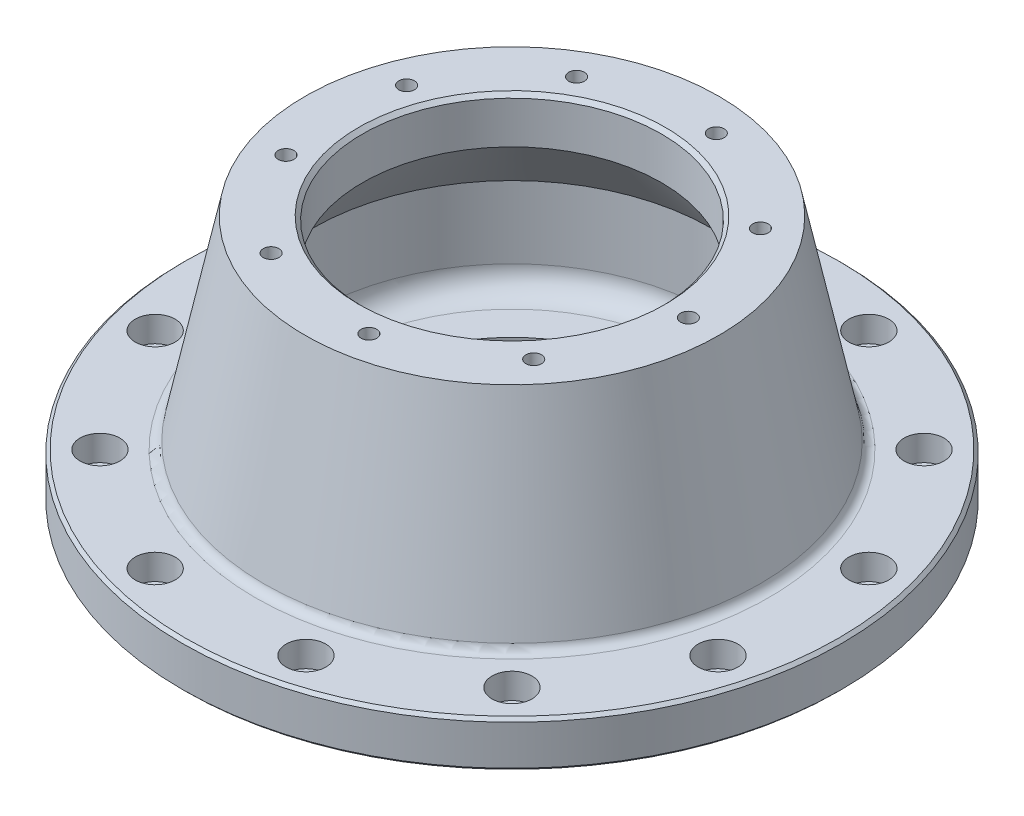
ISO-10303-21;
HEADER;
FILE_DESCRIPTION(('STEP AP214'),'2;1');
FILE_NAME('part.step','',(''),(''),'','','');
FILE_SCHEMA(('AUTOMOTIVE_DESIGN { 1 0 10303 214 1 1 1 1 }'));
ENDSEC;
DATA;
#1=APPLICATION_CONTEXT('core data for automotive mechanical design processes');
#2=APPLICATION_PROTOCOL_DEFINITION('international standard','automotive_design',2000,#1);
#3=PRODUCT_CONTEXT('',#1,'mechanical');
#4=PRODUCT('Part','Part','',(#3));
#5=PRODUCT_RELATED_PRODUCT_CATEGORY('part','',(#4));
#6=PRODUCT_DEFINITION_FORMATION('','',#4);
#7=PRODUCT_DEFINITION_CONTEXT('part definition',#1,'design');
#8=PRODUCT_DEFINITION('design','',#6,#7);
#9=PRODUCT_DEFINITION_SHAPE('','',#8);
#10=(LENGTH_UNIT() NAMED_UNIT(*) SI_UNIT(.MILLI.,.METRE.));
#11=(NAMED_UNIT(*) PLANE_ANGLE_UNIT() SI_UNIT($,.RADIAN.));
#12=(NAMED_UNIT(*) SI_UNIT($,.STERADIAN.) SOLID_ANGLE_UNIT());
#13=UNCERTAINTY_MEASURE_WITH_UNIT(LENGTH_MEASURE(1.E-05),#10,'distance_accuracy_value','');
#14=(GEOMETRIC_REPRESENTATION_CONTEXT(3) GLOBAL_UNCERTAINTY_ASSIGNED_CONTEXT((#13)) GLOBAL_UNIT_ASSIGNED_CONTEXT((#10,
#11,#12)) REPRESENTATION_CONTEXT('',''));
#15=CARTESIAN_POINT('',(0.,0.,0.));
#16=DIRECTION('',(0.,0.,1.));
#17=DIRECTION('',(1.,0.,0.));
#18=AXIS2_PLACEMENT_3D('',#15,#16,#17);
#19=CARTESIAN_POINT('',(0.,0.,0.));
#20=DIRECTION('',(0.,-1.,0.));
#21=DIRECTION('',(0.,0.,-1.));
#22=AXIS2_PLACEMENT_3D('',#19,#20,#21);
#23=CYLINDRICAL_SURFACE('',#22,215.);
#24=CARTESIAN_POINT('',(0.,1.99999999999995,0.));
#25=DIRECTION('',(0.,-1.,0.));
#26=DIRECTION('',(0.,0.,-1.));
#27=AXIS2_PLACEMENT_3D('',#24,#25,#26);
#28=CIRCLE('',#27,215.);
#29=CARTESIAN_POINT('',(0.,1.99999999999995,-215.));
#30=VERTEX_POINT('',#29);
#31=EDGE_CURVE('E46',#30,#30,#28,.F.);
#32=ORIENTED_EDGE('',*,*,#31,.T.);
#33=EDGE_LOOP('',(#32));
#34=FACE_BOUND('',#33,.T.);
#35=CARTESIAN_POINT('',(0.,28.,0.));
#36=DIRECTION('',(0.,1.,0.));
#37=DIRECTION('',(0.,0.,1.));
#38=AXIS2_PLACEMENT_3D('',#35,#36,#37);
#39=CIRCLE('',#38,215.);
#40=CARTESIAN_POINT('',(0.,28.,215.));
#41=VERTEX_POINT('',#40);
#42=EDGE_CURVE('E329',#41,#41,#39,.F.);
#43=ORIENTED_EDGE('',*,*,#42,.T.);
#44=EDGE_LOOP('',(#43));
#45=FACE_BOUND('',#44,.T.);
#46=ADVANCED_FACE('F38',(#34,#45),#23,.T.);
#47=CARTESIAN_POINT('',(215.,30.,0.));
#48=DIRECTION('',(0.,1.,0.));
#49=DIRECTION('',(0.,0.,1.));
#50=AXIS2_PLACEMENT_3D('',#47,#48,#49);
#51=PLANE('',#50);
#52=CARTESIAN_POINT('',(0.,30.,0.));
#53=DIRECTION('',(0.,1.,0.));
#54=DIRECTION('',(0.,0.,1.));
#55=AXIS2_PLACEMENT_3D('',#52,#53,#54);
#56=CIRCLE('',#55,213.);
#57=CARTESIAN_POINT('',(0.,30.,213.));
#58=VERTEX_POINT('',#57);
#59=EDGE_CURVE('E11',#58,#58,#56,.T.);
#60=ORIENTED_EDGE('',*,*,#59,.T.);
#61=EDGE_LOOP('',(#60));
#62=FACE_BOUND('',#61,.T.);
#63=CARTESIAN_POINT('',(-49.1756185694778,30.,-183.525906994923));
#64=DIRECTION('',(0.,1.,0.));
#65=DIRECTION('',(0.,0.,1.));
#66=AXIS2_PLACEMENT_3D('',#63,#64,#65);
#67=CIRCLE('',#66,13.);
#68=CARTESIAN_POINT('',(-49.1756185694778,30.,-170.525906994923));
#69=VERTEX_POINT('',#68);
#70=EDGE_CURVE('E137',#69,#69,#67,.T.);
#71=ORIENTED_EDGE('',*,*,#70,.F.);
#72=EDGE_LOOP('',(#71));
#73=FACE_BOUND('',#72,.T.);
#74=CARTESIAN_POINT('',(-134.350288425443,30.,-134.350288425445));
#75=DIRECTION('',(0.,1.,0.));
#76=DIRECTION('',(0.,0.,1.));
#77=AXIS2_PLACEMENT_3D('',#74,#75,#76);
#78=CIRCLE('',#77,13.);
#79=CARTESIAN_POINT('',(-134.350288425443,30.,-121.350288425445));
#80=VERTEX_POINT('',#79);
#81=EDGE_CURVE('E149',#80,#80,#78,.T.);
#82=ORIENTED_EDGE('',*,*,#81,.F.);
#83=EDGE_LOOP('',(#82));
#84=FACE_BOUND('',#83,.T.);
#85=CARTESIAN_POINT('',(-183.525906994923,30.,-49.1756185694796));
#86=DIRECTION('',(0.,1.,0.));
#87=DIRECTION('',(0.,0.,1.));
#88=AXIS2_PLACEMENT_3D('',#85,#86,#87);
#89=CIRCLE('',#88,13.);
#90=CARTESIAN_POINT('',(-183.525906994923,30.,-36.1756185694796));
#91=VERTEX_POINT('',#90);
#92=EDGE_CURVE('E161',#91,#91,#89,.T.);
#93=ORIENTED_EDGE('',*,*,#92,.F.);
#94=EDGE_LOOP('',(#93));
#95=FACE_BOUND('',#94,.T.);
#96=CARTESIAN_POINT('',(-183.525906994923,30.,49.1756185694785));
#97=DIRECTION('',(0.,1.,0.));
#98=DIRECTION('',(0.,0.,1.));
#99=AXIS2_PLACEMENT_3D('',#96,#97,#98);
#100=CIRCLE('',#99,13.);
#101=CARTESIAN_POINT('',(-183.525906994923,30.,62.1756185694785));
#102=VERTEX_POINT('',#101);
#103=EDGE_CURVE('E173',#102,#102,#100,.T.);
#104=ORIENTED_EDGE('',*,*,#103,.F.);
#105=EDGE_LOOP('',(#104));
#106=FACE_BOUND('',#105,.T.);
#107=CARTESIAN_POINT('',(-134.350288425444,30.,134.350288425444));
#108=DIRECTION('',(0.,1.,0.));
#109=DIRECTION('',(0.,0.,1.));
#110=AXIS2_PLACEMENT_3D('',#107,#108,#109);
#111=CIRCLE('',#110,13.);
#112=CARTESIAN_POINT('',(-134.350288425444,30.,147.350288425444));
#113=VERTEX_POINT('',#112);
#114=EDGE_CURVE('E185',#113,#113,#111,.T.);
#115=ORIENTED_EDGE('',*,*,#114,.F.);
#116=EDGE_LOOP('',(#115));
#117=FACE_BOUND('',#116,.T.);
#118=CARTESIAN_POINT('',(-49.1756185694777,30.,183.525906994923));
#119=DIRECTION('',(0.,1.,0.));
#120=DIRECTION('',(0.,0.,1.));
#121=AXIS2_PLACEMENT_3D('',#118,#119,#120);
#122=CIRCLE('',#121,13.);
#123=CARTESIAN_POINT('',(-49.1756185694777,30.,196.525906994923));
#124=VERTEX_POINT('',#123);
#125=EDGE_CURVE('E197',#124,#124,#122,.T.);
#126=ORIENTED_EDGE('',*,*,#125,.F.);
#127=EDGE_LOOP('',(#126));
#128=FACE_BOUND('',#127,.T.);
#129=CARTESIAN_POINT('',(49.1756185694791,30.,183.525906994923));
#130=DIRECTION('',(0.,1.,0.));
#131=DIRECTION('',(0.,0.,1.));
#132=AXIS2_PLACEMENT_3D('',#129,#130,#131);
#133=CIRCLE('',#132,13.);
#134=CARTESIAN_POINT('',(49.1756185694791,30.,196.525906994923));
#135=VERTEX_POINT('',#134);
#136=EDGE_CURVE('E209',#135,#135,#133,.T.);
#137=ORIENTED_EDGE('',*,*,#136,.F.);
#138=EDGE_LOOP('',(#137));
#139=FACE_BOUND('',#138,.T.);
#140=CARTESIAN_POINT('',(134.350288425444,30.,134.350288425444));
#141=DIRECTION('',(0.,1.,0.));
#142=DIRECTION('',(0.,0.,1.));
#143=AXIS2_PLACEMENT_3D('',#140,#141,#142);
#144=CIRCLE('',#143,13.);
#145=CARTESIAN_POINT('',(134.350288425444,30.,147.350288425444));
#146=VERTEX_POINT('',#145);
#147=EDGE_CURVE('E221',#146,#146,#144,.T.);
#148=ORIENTED_EDGE('',*,*,#147,.F.);
#149=EDGE_LOOP('',(#148));
#150=FACE_BOUND('',#149,.T.);
#151=CARTESIAN_POINT('',(183.525906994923,30.,49.1756185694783));
#152=DIRECTION('',(0.,1.,0.));
#153=DIRECTION('',(0.,0.,1.));
#154=AXIS2_PLACEMENT_3D('',#151,#152,#153);
#155=CIRCLE('',#154,13.);
#156=CARTESIAN_POINT('',(183.525906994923,30.,62.1756185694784));
#157=VERTEX_POINT('',#156);
#158=EDGE_CURVE('E233',#157,#157,#155,.T.);
#159=ORIENTED_EDGE('',*,*,#158,.F.);
#160=EDGE_LOOP('',(#159));
#161=FACE_BOUND('',#160,.T.);
#162=CARTESIAN_POINT('',(183.525906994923,30.,-49.1756185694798));
#163=DIRECTION('',(0.,1.,0.));
#164=DIRECTION('',(0.,0.,1.));
#165=AXIS2_PLACEMENT_3D('',#162,#163,#164);
#166=CIRCLE('',#165,13.);
#167=CARTESIAN_POINT('',(183.525906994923,30.,-36.1756185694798));
#168=VERTEX_POINT('',#167);
#169=EDGE_CURVE('E245',#168,#168,#166,.T.);
#170=ORIENTED_EDGE('',*,*,#169,.F.);
#171=EDGE_LOOP('',(#170));
#172=FACE_BOUND('',#171,.T.);
#173=CARTESIAN_POINT('',(134.350288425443,30.,-134.350288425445));
#174=DIRECTION('',(0.,1.,0.));
#175=DIRECTION('',(0.,0.,1.));
#176=AXIS2_PLACEMENT_3D('',#173,#174,#175);
#177=CIRCLE('',#176,13.);
#178=CARTESIAN_POINT('',(134.350288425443,30.,-121.350288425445));
#179=VERTEX_POINT('',#178);
#180=EDGE_CURVE('E257',#179,#179,#177,.T.);
#181=ORIENTED_EDGE('',*,*,#180,.F.);
#182=EDGE_LOOP('',(#181));
#183=FACE_BOUND('',#182,.T.);
#184=CARTESIAN_POINT('',(49.1756185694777,30.,-183.525906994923));
#185=DIRECTION('',(0.,1.,0.));
#186=DIRECTION('',(0.,0.,1.));
#187=AXIS2_PLACEMENT_3D('',#184,#185,#186);
#188=CIRCLE('',#187,13.);
#189=CARTESIAN_POINT('',(49.1756185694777,30.,-170.525906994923));
#190=VERTEX_POINT('',#189);
#191=EDGE_CURVE('E269',#190,#190,#188,.T.);
#192=ORIENTED_EDGE('',*,*,#191,.F.);
#193=EDGE_LOOP('',(#192));
#194=FACE_BOUND('',#193,.T.);
#195=CARTESIAN_POINT('',(0.,30.,0.));
#196=DIRECTION('',(0.,1.,0.));
#197=DIRECTION('',(0.,0.,1.));
#198=AXIS2_PLACEMENT_3D('',#195,#196,#197);
#199=CIRCLE('',#198,167.378825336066);
#200=CARTESIAN_POINT('',(0.,30.,167.378825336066));
#201=VERTEX_POINT('',#200);
#202=EDGE_CURVE('E296',#201,#201,#199,.F.);
#203=ORIENTED_EDGE('',*,*,#202,.T.);
#204=EDGE_LOOP('',(#203));
#205=FACE_BOUND('',#204,.T.);
#206=ADVANCED_FACE('F393',(#62,#73,#84,#95,#106,#117,#128,#139,#150,#161,#172,#183,#194,#205),
#51,.T.);
#207=CARTESIAN_POINT('',(0.,30.,0.));
#208=DIRECTION('',(0.,-1.,0.));
#209=DIRECTION('',(0.,0.,-1.));
#210=AXIS2_PLACEMENT_3D('',#207,#208,#209);
#211=CONICAL_SURFACE('',#210,162.5,0.20539538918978);
#212=CARTESIAN_POINT('',(0.,34.7762744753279,0.));
#213=DIRECTION('',(0.,-1.,0.));
#214=DIRECTION('',(0.,0.,-1.));
#215=AXIS2_PLACEMENT_3D('',#212,#213,#214);
#216=CIRCLE('',#215,161.50494281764);
#217=CARTESIAN_POINT('',(0.,34.7762744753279,-161.50494281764));
#218=VERTEX_POINT('',#217);
#219=EDGE_CURVE('E299',#218,#218,#216,.F.);
#220=ORIENTED_EDGE('',*,*,#219,.T.);
#221=EDGE_LOOP('',(#220));
#222=FACE_BOUND('',#221,.T.);
#223=CARTESIAN_POINT('',(0.,161.999999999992,0.));
#224=DIRECTION('',(0.,-1.,0.));
#225=DIRECTION('',(0.,0.,-1.));
#226=AXIS2_PLACEMENT_3D('',#223,#224,#225);
#227=CIRCLE('',#226,135.);
#228=CARTESIAN_POINT('',(0.,161.999999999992,-135.));
#229=VERTEX_POINT('',#228);
#230=EDGE_CURVE('E293',#229,#229,#227,.T.);
#231=ORIENTED_EDGE('',*,*,#230,.T.);
#232=EDGE_LOOP('',(#231));
#233=FACE_BOUND('',#232,.T.);
#234=ADVANCED_FACE('F396',(#222,#233),#211,.T.);
#235=CARTESIAN_POINT('',(135.,161.999999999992,0.));
#236=DIRECTION('',(0.,1.,0.));
#237=DIRECTION('',(0.,0.,1.));
#238=AXIS2_PLACEMENT_3D('',#235,#236,#237);
#239=PLANE('',#238);
#240=CARTESIAN_POINT('',(88.0951109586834,161.999999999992,-73.920575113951));
#241=DIRECTION('',(0.,1.,0.));
#242=DIRECTION('',(0.,0.,1.));
#243=AXIS2_PLACEMENT_3D('',#240,#241,#242);
#244=CIRCLE('',#243,5.09999999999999);
#245=CARTESIAN_POINT('',(88.0951109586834,161.999999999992,-68.820575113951));
#246=VERTEX_POINT('',#245);
#247=EDGE_CURVE('E85',#246,#246,#244,.T.);
#248=ORIENTED_EDGE('',*,*,#247,.F.);
#249=EDGE_LOOP('',(#248));
#250=FACE_BOUND('',#249,.T.);
#251=CARTESIAN_POINT('',(19.9695404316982,161.999999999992,-113.252891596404));
#252=DIRECTION('',(0.,1.,0.));
#253=DIRECTION('',(0.,0.,1.));
#254=AXIS2_PLACEMENT_3D('',#251,#252,#253);
#255=CIRCLE('',#254,5.09999999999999);
#256=CARTESIAN_POINT('',(19.9695404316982,161.999999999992,-108.152891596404));
#257=VERTEX_POINT('',#256);
#258=EDGE_CURVE('E84',#257,#257,#255,.T.);
#259=ORIENTED_EDGE('',*,*,#258,.F.);
#260=EDGE_LOOP('',(#259));
#261=FACE_BOUND('',#260,.T.);
#262=CARTESIAN_POINT('',(-57.4999999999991,161.999999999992,-99.592921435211));
#263=DIRECTION('',(0.,1.,0.));
#264=DIRECTION('',(0.,0.,1.));
#265=AXIS2_PLACEMENT_3D('',#262,#263,#264);
#266=CIRCLE('',#265,5.09999999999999);
#267=CARTESIAN_POINT('',(-57.4999999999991,161.999999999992,-94.492921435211));
#268=VERTEX_POINT('',#267);
#269=EDGE_CURVE('E95',#268,#268,#266,.T.);
#270=ORIENTED_EDGE('',*,*,#269,.F.);
#271=EDGE_LOOP('',(#270));
#272=FACE_BOUND('',#271,.T.);
#273=CARTESIAN_POINT('',(-108.064651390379,161.999999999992,-39.3323164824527));
#274=DIRECTION('',(0.,1.,0.));
#275=DIRECTION('',(0.,0.,1.));
#276=AXIS2_PLACEMENT_3D('',#273,#274,#275);
#277=CIRCLE('',#276,5.09999999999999);
#278=CARTESIAN_POINT('',(-108.064651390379,161.999999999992,-34.2323164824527));
#279=VERTEX_POINT('',#278);
#280=EDGE_CURVE('E101',#279,#279,#277,.T.);
#281=ORIENTED_EDGE('',*,*,#280,.F.);
#282=EDGE_LOOP('',(#281));
#283=FACE_BOUND('',#282,.T.);
#284=CARTESIAN_POINT('',(-108.06465139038,161.999999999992,39.3323164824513));
#285=DIRECTION('',(0.,1.,0.));
#286=DIRECTION('',(0.,0.,1.));
#287=AXIS2_PLACEMENT_3D('',#284,#285,#286);
#288=CIRCLE('',#287,5.09999999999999);
#289=CARTESIAN_POINT('',(-108.06465139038,161.999999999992,44.4323164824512));
#290=VERTEX_POINT('',#289);
#291=EDGE_CURVE('E107',#290,#290,#288,.T.);
#292=ORIENTED_EDGE('',*,*,#291,.F.);
#293=EDGE_LOOP('',(#292));
#294=FACE_BOUND('',#293,.T.);
#295=CARTESIAN_POINT('',(-57.5000000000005,161.999999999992,99.5929214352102));
#296=DIRECTION('',(0.,1.,0.));
#297=DIRECTION('',(0.,0.,1.));
#298=AXIS2_PLACEMENT_3D('',#295,#296,#297);
#299=CIRCLE('',#298,5.09999999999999);
#300=CARTESIAN_POINT('',(-57.5000000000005,161.999999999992,104.69292143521));
#301=VERTEX_POINT('',#300);
#302=EDGE_CURVE('E113',#301,#301,#299,.T.);
#303=ORIENTED_EDGE('',*,*,#302,.F.);
#304=EDGE_LOOP('',(#303));
#305=FACE_BOUND('',#304,.T.);
#306=CARTESIAN_POINT('',(19.9695404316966,161.999999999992,113.252891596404));
#307=DIRECTION('',(0.,1.,0.));
#308=DIRECTION('',(0.,0.,1.));
#309=AXIS2_PLACEMENT_3D('',#306,#307,#308);
#310=CIRCLE('',#309,5.09999999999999);
#311=CARTESIAN_POINT('',(19.9695404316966,161.999999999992,118.352891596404));
#312=VERTEX_POINT('',#311);
#313=EDGE_CURVE('E119',#312,#312,#310,.T.);
#314=ORIENTED_EDGE('',*,*,#313,.F.);
#315=EDGE_LOOP('',(#314));
#316=FACE_BOUND('',#315,.T.);
#317=CARTESIAN_POINT('',(88.0951109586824,161.999999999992,73.9205751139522));
#318=DIRECTION('',(0.,1.,0.));
#319=DIRECTION('',(0.,0.,1.));
#320=AXIS2_PLACEMENT_3D('',#317,#318,#319);
#321=CIRCLE('',#320,5.09999999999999);
#322=CARTESIAN_POINT('',(88.0951109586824,161.999999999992,79.0205751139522));
#323=VERTEX_POINT('',#322);
#324=EDGE_CURVE('E125',#323,#323,#321,.T.);
#325=ORIENTED_EDGE('',*,*,#324,.F.);
#326=EDGE_LOOP('',(#325));
#327=FACE_BOUND('',#326,.T.);
#328=CARTESIAN_POINT('',(115.,161.999999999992,0.));
#329=DIRECTION('',(0.,1.,0.));
#330=DIRECTION('',(0.,0.,1.));
#331=AXIS2_PLACEMENT_3D('',#328,#329,#330);
#332=CIRCLE('',#331,5.09999999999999);
#333=CARTESIAN_POINT('',(115.,161.999999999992,5.09999999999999));
#334=VERTEX_POINT('',#333);
#335=EDGE_CURVE('E131',#334,#334,#332,.T.);
#336=ORIENTED_EDGE('',*,*,#335,.F.);
#337=EDGE_LOOP('',(#336));
#338=FACE_BOUND('',#337,.T.);
#339=CARTESIAN_POINT('',(0.,161.999999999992,0.));
#340=DIRECTION('',(0.,1.,0.));
#341=DIRECTION('',(0.,0.,1.));
#342=AXIS2_PLACEMENT_3D('',#339,#340,#341);
#343=CIRCLE('',#342,99.9999999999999);
#344=CARTESIAN_POINT('',(0.,161.999999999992,99.9999999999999));
#345=VERTEX_POINT('',#344);
#346=EDGE_CURVE('E314',#345,#345,#343,.F.);
#347=ORIENTED_EDGE('',*,*,#346,.T.);
#348=EDGE_LOOP('',(#347));
#349=FACE_BOUND('',#348,.T.);
#350=ORIENTED_EDGE('',*,*,#230,.F.);
#351=EDGE_LOOP('',(#350));
#352=FACE_BOUND('',#351,.T.);
#353=ADVANCED_FACE('F415',(#250,#261,#272,#283,#294,#305,#316,#327,#338,#349,#352),#239,.T.);
#354=CARTESIAN_POINT('',(0.,0.,0.));
#355=DIRECTION('',(0.,-1.,0.));
#356=DIRECTION('',(0.,0.,-1.));
#357=AXIS2_PLACEMENT_3D('',#354,#355,#356);
#358=CYLINDRICAL_SURFACE('',#357,97.5);
#359=CARTESIAN_POINT('',(0.,159.499999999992,0.));
#360=DIRECTION('',(0.,1.,0.));
#361=DIRECTION('',(0.,0.,1.));
#362=AXIS2_PLACEMENT_3D('',#359,#360,#361);
#363=CIRCLE('',#362,97.5);
#364=CARTESIAN_POINT('',(0.,159.499999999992,97.5));
#365=VERTEX_POINT('',#364);
#366=EDGE_CURVE('E317',#365,#365,#363,.T.);
#367=ORIENTED_EDGE('',*,*,#366,.T.);
#368=EDGE_LOOP('',(#367));
#369=FACE_BOUND('',#368,.T.);
#370=CARTESIAN_POINT('',(0.,131.999999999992,0.));
#371=DIRECTION('',(0.,-1.,0.));
#372=DIRECTION('',(0.,0.,-1.));
#373=AXIS2_PLACEMENT_3D('',#370,#371,#372);
#374=CIRCLE('',#373,97.5);
#375=CARTESIAN_POINT('',(0.,131.999999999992,-97.5));
#376=VERTEX_POINT('',#375);
#377=EDGE_CURVE('E290',#376,#376,#374,.T.);
#378=ORIENTED_EDGE('',*,*,#377,.T.);
#379=EDGE_LOOP('',(#378));
#380=FACE_BOUND('',#379,.T.);
#381=ADVANCED_FACE('F419',(#369,#380),#358,.F.);
#382=CARTESIAN_POINT('',(0.,131.999999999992,0.));
#383=DIRECTION('',(0.,-1.,0.));
#384=DIRECTION('',(0.,0.,-1.));
#385=AXIS2_PLACEMENT_3D('',#382,#383,#384);
#386=CONICAL_SURFACE('',#385,97.5,0.658565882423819);
#387=CARTESIAN_POINT('',(0.,90.,0.));
#388=DIRECTION('',(0.,-1.,0.));
#389=DIRECTION('',(0.,0.,-1.));
#390=AXIS2_PLACEMENT_3D('',#387,#388,#389);
#391=CIRCLE('',#390,130.);
#392=CARTESIAN_POINT('',(0.,90.,-130.));
#393=VERTEX_POINT('',#392);
#394=EDGE_CURVE('E287',#393,#393,#391,.T.);
#395=ORIENTED_EDGE('',*,*,#394,.T.);
#396=EDGE_LOOP('',(#395));
#397=FACE_BOUND('',#396,.T.);
#398=ORIENTED_EDGE('',*,*,#377,.F.);
#399=EDGE_LOOP('',(#398));
#400=FACE_BOUND('',#399,.T.);
#401=ADVANCED_FACE('F423',(#397,#400),#386,.F.);
#402=CARTESIAN_POINT('',(0.,0.,0.));
#403=DIRECTION('',(0.,-1.,0.));
#404=DIRECTION('',(0.,0.,-1.));
#405=AXIS2_PLACEMENT_3D('',#402,#403,#404);
#406=CYLINDRICAL_SURFACE('',#405,130.);
#407=CARTESIAN_POINT('',(0.,43.,0.));
#408=DIRECTION('',(0.,1.,0.));
#409=DIRECTION('',(0.,0.,1.));
#410=AXIS2_PLACEMENT_3D('',#407,#408,#409);
#411=CIRCLE('',#410,130.);
#412=CARTESIAN_POINT('',(0.,43.,130.));
#413=VERTEX_POINT('',#412);
#414=EDGE_CURVE('E320',#413,#413,#411,.F.);
#415=ORIENTED_EDGE('',*,*,#414,.T.);
#416=EDGE_LOOP('',(#415));
#417=FACE_BOUND('',#416,.T.);
#418=ORIENTED_EDGE('',*,*,#394,.F.);
#419=EDGE_LOOP('',(#418));
#420=FACE_BOUND('',#419,.T.);
#421=ADVANCED_FACE('F427',(#417,#420),#406,.F.);
#422=CARTESIAN_POINT('',(130.,28.,0.));
#423=DIRECTION('',(0.,1.,0.));
#424=DIRECTION('',(0.,0.,1.));
#425=AXIS2_PLACEMENT_3D('',#422,#423,#424);
#426=PLANE('',#425);
#427=CARTESIAN_POINT('',(0.,28.,0.));
#428=DIRECTION('',(0.,1.,0.));
#429=DIRECTION('',(0.,0.,1.));
#430=AXIS2_PLACEMENT_3D('',#427,#428,#429);
#431=CIRCLE('',#430,115.);
#432=CARTESIAN_POINT('',(0.,28.,115.));
#433=VERTEX_POINT('',#432);
#434=EDGE_CURVE('E323',#433,#433,#431,.T.);
#435=ORIENTED_EDGE('',*,*,#434,.T.);
#436=EDGE_LOOP('',(#435));
#437=FACE_BOUND('',#436,.T.);
#438=CARTESIAN_POINT('',(0.,28.,0.));
#439=DIRECTION('',(0.,-1.,0.));
#440=DIRECTION('',(0.,0.,-1.));
#441=AXIS2_PLACEMENT_3D('',#438,#439,#440);
#442=CIRCLE('',#441,92.5);
#443=CARTESIAN_POINT('',(0.,28.,-92.5));
#444=VERTEX_POINT('',#443);
#445=EDGE_CURVE('E284',#444,#444,#442,.T.);
#446=ORIENTED_EDGE('',*,*,#445,.T.);
#447=EDGE_LOOP('',(#446));
#448=FACE_BOUND('',#447,.T.);
#449=ADVANCED_FACE('F431',(#437,#448),#426,.T.);
#450=CARTESIAN_POINT('',(0.,0.,0.));
#451=DIRECTION('',(0.,-1.,0.));
#452=DIRECTION('',(0.,0.,-1.));
#453=AXIS2_PLACEMENT_3D('',#450,#451,#452);
#454=CYLINDRICAL_SURFACE('',#453,92.5);
#455=CARTESIAN_POINT('',(0.,15.,0.));
#456=DIRECTION('',(0.,-1.,0.));
#457=DIRECTION('',(0.,0.,-1.));
#458=AXIS2_PLACEMENT_3D('',#455,#456,#457);
#459=CIRCLE('',#458,92.5);
#460=CARTESIAN_POINT('',(0.,15.,-92.5));
#461=VERTEX_POINT('',#460);
#462=EDGE_CURVE('E281',#461,#461,#459,.T.);
#463=ORIENTED_EDGE('',*,*,#462,.T.);
#464=EDGE_LOOP('',(#463));
#465=FACE_BOUND('',#464,.T.);
#466=ORIENTED_EDGE('',*,*,#445,.F.);
#467=EDGE_LOOP('',(#466));
#468=FACE_BOUND('',#467,.T.);
#469=ADVANCED_FACE('F435',(#465,#468),#454,.F.);
#470=CARTESIAN_POINT('',(92.5,15.,0.));
#471=DIRECTION('',(0.,1.,0.));
#472=DIRECTION('',(0.,0.,1.));
#473=AXIS2_PLACEMENT_3D('',#470,#471,#472);
#474=PLANE('',#473);
#475=CARTESIAN_POINT('',(0.,15.,0.));
#476=DIRECTION('',(0.,1.,0.));
#477=DIRECTION('',(0.,0.,1.));
#478=AXIS2_PLACEMENT_3D('',#475,#476,#477);
#479=CIRCLE('',#478,81.8);
#480=CARTESIAN_POINT('',(0.,15.,81.8));
#481=VERTEX_POINT('',#480);
#482=EDGE_CURVE('E302',#481,#481,#479,.F.);
#483=ORIENTED_EDGE('',*,*,#482,.T.);
#484=EDGE_LOOP('',(#483));
#485=FACE_BOUND('',#484,.T.);
#486=ORIENTED_EDGE('',*,*,#462,.F.);
#487=EDGE_LOOP('',(#486));
#488=FACE_BOUND('',#487,.T.);
#489=ADVANCED_FACE('F439',(#485,#488),#474,.T.);
#490=CARTESIAN_POINT('',(0.,0.,0.));
#491=DIRECTION('',(0.,-1.,0.));
#492=DIRECTION('',(0.,0.,-1.));
#493=AXIS2_PLACEMENT_3D('',#490,#491,#492);
#494=CYLINDRICAL_SURFACE('',#493,80.);
#495=CARTESIAN_POINT('',(0.,13.2,0.));
#496=DIRECTION('',(0.,1.,0.));
#497=DIRECTION('',(0.,0.,1.));
#498=AXIS2_PLACEMENT_3D('',#495,#496,#497);
#499=CIRCLE('',#498,80.);
#500=CARTESIAN_POINT('',(0.,13.2,80.));
#501=VERTEX_POINT('',#500);
#502=EDGE_CURVE('E308',#501,#501,#499,.T.);
#503=ORIENTED_EDGE('',*,*,#502,.T.);
#504=EDGE_LOOP('',(#503));
#505=FACE_BOUND('',#504,.T.);
#506=CARTESIAN_POINT('',(0.,1.80000000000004,0.));
#507=DIRECTION('',(0.,-1.,0.));
#508=DIRECTION('',(0.,0.,-1.));
#509=AXIS2_PLACEMENT_3D('',#506,#507,#508);
#510=CIRCLE('',#509,80.);
#511=CARTESIAN_POINT('',(0.,1.80000000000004,-80.));
#512=VERTEX_POINT('',#511);
#513=EDGE_CURVE('E305',#512,#512,#510,.T.);
#514=ORIENTED_EDGE('',*,*,#513,.T.);
#515=EDGE_LOOP('',(#514));
#516=FACE_BOUND('',#515,.T.);
#517=ADVANCED_FACE('F346',(#505,#516),#494,.F.);
#518=CARTESIAN_POINT('',(80.,0.,0.));
#519=DIRECTION('',(0.,-1.,0.));
#520=DIRECTION('',(0.,0.,-1.));
#521=AXIS2_PLACEMENT_3D('',#518,#519,#520);
#522=PLANE('',#521);
#523=CARTESIAN_POINT('',(0.,0.,0.));
#524=DIRECTION('',(0.,-1.,0.));
#525=DIRECTION('',(0.,0.,-1.));
#526=AXIS2_PLACEMENT_3D('',#523,#524,#525);
#527=CIRCLE('',#526,213.);
#528=CARTESIAN_POINT('',(0.,0.,-213.));
#529=VERTEX_POINT('',#528);
#530=EDGE_CURVE('E326',#529,#529,#527,.T.);
#531=ORIENTED_EDGE('',*,*,#530,.T.);
#532=EDGE_LOOP('',(#531));
#533=FACE_BOUND('',#532,.T.);
#534=CARTESIAN_POINT('',(0.,0.,0.));
#535=DIRECTION('',(0.,-1.,0.));
#536=DIRECTION('',(0.,0.,-1.));
#537=AXIS2_PLACEMENT_3D('',#534,#535,#536);
#538=CIRCLE('',#537,81.8000000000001);
#539=CARTESIAN_POINT('',(0.,0.,-81.8000000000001));
#540=VERTEX_POINT('',#539);
#541=EDGE_CURVE('E311',#540,#540,#538,.F.);
#542=ORIENTED_EDGE('',*,*,#541,.T.);
#543=EDGE_LOOP('',(#542));
#544=FACE_BOUND('',#543,.T.);
#545=CARTESIAN_POINT('',(-49.1756185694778,0.,-183.525906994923));
#546=DIRECTION('',(0.,1.,0.));
#547=DIRECTION('',(0.,0.,1.));
#548=AXIS2_PLACEMENT_3D('',#545,#546,#547);
#549=CIRCLE('',#548,8.74999999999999);
#550=CARTESIAN_POINT('',(-49.1756185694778,0.,-174.775906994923));
#551=VERTEX_POINT('',#550);
#552=EDGE_CURVE('E146',#551,#551,#549,.T.);
#553=ORIENTED_EDGE('',*,*,#552,.T.);
#554=EDGE_LOOP('',(#553));
#555=FACE_BOUND('',#554,.T.);
#556=CARTESIAN_POINT('',(-134.350288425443,0.,-134.350288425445));
#557=DIRECTION('',(0.,1.,0.));
#558=DIRECTION('',(0.,0.,1.));
#559=AXIS2_PLACEMENT_3D('',#556,#557,#558);
#560=CIRCLE('',#559,8.74999999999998);
#561=CARTESIAN_POINT('',(-134.350288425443,0.,-125.600288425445));
#562=VERTEX_POINT('',#561);
#563=EDGE_CURVE('E158',#562,#562,#560,.T.);
#564=ORIENTED_EDGE('',*,*,#563,.T.);
#565=EDGE_LOOP('',(#564));
#566=FACE_BOUND('',#565,.T.);
#567=CARTESIAN_POINT('',(-183.525906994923,0.,-49.1756185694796));
#568=DIRECTION('',(0.,1.,0.));
#569=DIRECTION('',(0.,0.,1.));
#570=AXIS2_PLACEMENT_3D('',#567,#568,#569);
#571=CIRCLE('',#570,8.75000000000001);
#572=CARTESIAN_POINT('',(-183.525906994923,0.,-40.4256185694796));
#573=VERTEX_POINT('',#572);
#574=EDGE_CURVE('E170',#573,#573,#571,.T.);
#575=ORIENTED_EDGE('',*,*,#574,.T.);
#576=EDGE_LOOP('',(#575));
#577=FACE_BOUND('',#576,.T.);
#578=CARTESIAN_POINT('',(-183.525906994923,0.,49.1756185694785));
#579=DIRECTION('',(0.,1.,0.));
#580=DIRECTION('',(0.,0.,1.));
#581=AXIS2_PLACEMENT_3D('',#578,#579,#580);
#582=CIRCLE('',#581,8.74999999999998);
#583=CARTESIAN_POINT('',(-183.525906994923,0.,57.9256185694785));
#584=VERTEX_POINT('',#583);
#585=EDGE_CURVE('E182',#584,#584,#582,.T.);
#586=ORIENTED_EDGE('',*,*,#585,.T.);
#587=EDGE_LOOP('',(#586));
#588=FACE_BOUND('',#587,.T.);
#589=CARTESIAN_POINT('',(-134.350288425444,0.,134.350288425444));
#590=DIRECTION('',(0.,1.,0.));
#591=DIRECTION('',(0.,0.,1.));
#592=AXIS2_PLACEMENT_3D('',#589,#590,#591);
#593=CIRCLE('',#592,8.75000000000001);
#594=CARTESIAN_POINT('',(-134.350288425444,0.,143.100288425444));
#595=VERTEX_POINT('',#594);
#596=EDGE_CURVE('E194',#595,#595,#593,.T.);
#597=ORIENTED_EDGE('',*,*,#596,.T.);
#598=EDGE_LOOP('',(#597));
#599=FACE_BOUND('',#598,.T.);
#600=CARTESIAN_POINT('',(-49.1756185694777,0.,183.525906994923));
#601=DIRECTION('',(0.,1.,0.));
#602=DIRECTION('',(0.,0.,1.));
#603=AXIS2_PLACEMENT_3D('',#600,#601,#602);
#604=CIRCLE('',#603,8.74999999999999);
#605=CARTESIAN_POINT('',(-49.1756185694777,0.,192.275906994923));
#606=VERTEX_POINT('',#605);
#607=EDGE_CURVE('E206',#606,#606,#604,.T.);
#608=ORIENTED_EDGE('',*,*,#607,.T.);
#609=EDGE_LOOP('',(#608));
#610=FACE_BOUND('',#609,.T.);
#611=CARTESIAN_POINT('',(49.1756185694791,0.,183.525906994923));
#612=DIRECTION('',(0.,1.,0.));
#613=DIRECTION('',(0.,0.,1.));
#614=AXIS2_PLACEMENT_3D('',#611,#612,#613);
#615=CIRCLE('',#614,8.74999999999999);
#616=CARTESIAN_POINT('',(49.1756185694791,0.,192.275906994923));
#617=VERTEX_POINT('',#616);
#618=EDGE_CURVE('E218',#617,#617,#615,.T.);
#619=ORIENTED_EDGE('',*,*,#618,.T.);
#620=EDGE_LOOP('',(#619));
#621=FACE_BOUND('',#620,.T.);
#622=CARTESIAN_POINT('',(134.350288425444,0.,134.350288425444));
#623=DIRECTION('',(0.,1.,0.));
#624=DIRECTION('',(0.,0.,1.));
#625=AXIS2_PLACEMENT_3D('',#622,#623,#624);
#626=CIRCLE('',#625,8.75000000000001);
#627=CARTESIAN_POINT('',(134.350288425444,0.,143.100288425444));
#628=VERTEX_POINT('',#627);
#629=EDGE_CURVE('E230',#628,#628,#626,.T.);
#630=ORIENTED_EDGE('',*,*,#629,.T.);
#631=EDGE_LOOP('',(#630));
#632=FACE_BOUND('',#631,.T.);
#633=CARTESIAN_POINT('',(183.525906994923,0.,49.1756185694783));
#634=DIRECTION('',(0.,1.,0.));
#635=DIRECTION('',(0.,0.,1.));
#636=AXIS2_PLACEMENT_3D('',#633,#634,#635);
#637=CIRCLE('',#636,8.74999999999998);
#638=CARTESIAN_POINT('',(183.525906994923,0.,57.9256185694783));
#639=VERTEX_POINT('',#638);
#640=EDGE_CURVE('E242',#639,#639,#637,.T.);
#641=ORIENTED_EDGE('',*,*,#640,.T.);
#642=EDGE_LOOP('',(#641));
#643=FACE_BOUND('',#642,.T.);
#644=CARTESIAN_POINT('',(183.525906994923,0.,-49.1756185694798));
#645=DIRECTION('',(0.,1.,0.));
#646=DIRECTION('',(0.,0.,1.));
#647=AXIS2_PLACEMENT_3D('',#644,#645,#646);
#648=CIRCLE('',#647,8.74999999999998);
#649=CARTESIAN_POINT('',(183.525906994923,0.,-40.4256185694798));
#650=VERTEX_POINT('',#649);
#651=EDGE_CURVE('E254',#650,#650,#648,.T.);
#652=ORIENTED_EDGE('',*,*,#651,.T.);
#653=EDGE_LOOP('',(#652));
#654=FACE_BOUND('',#653,.T.);
#655=CARTESIAN_POINT('',(134.350288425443,0.,-134.350288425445));
#656=DIRECTION('',(0.,1.,0.));
#657=DIRECTION('',(0.,0.,1.));
#658=AXIS2_PLACEMENT_3D('',#655,#656,#657);
#659=CIRCLE('',#658,8.74999999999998);
#660=CARTESIAN_POINT('',(134.350288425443,0.,-125.600288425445));
#661=VERTEX_POINT('',#660);
#662=EDGE_CURVE('E266',#661,#661,#659,.T.);
#663=ORIENTED_EDGE('',*,*,#662,.T.);
#664=EDGE_LOOP('',(#663));
#665=FACE_BOUND('',#664,.T.);
#666=CARTESIAN_POINT('',(49.1756185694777,0.,-183.525906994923));
#667=DIRECTION('',(0.,1.,0.));
#668=DIRECTION('',(0.,0.,1.));
#669=AXIS2_PLACEMENT_3D('',#666,#667,#668);
#670=CIRCLE('',#669,8.74999999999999);
#671=CARTESIAN_POINT('',(49.1756185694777,0.,-174.775906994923));
#672=VERTEX_POINT('',#671);
#673=EDGE_CURVE('E278',#672,#672,#670,.T.);
#674=ORIENTED_EDGE('',*,*,#673,.T.);
#675=EDGE_LOOP('',(#674));
#676=FACE_BOUND('',#675,.T.);
#677=ADVANCED_FACE('F342',(#533,#544,#555,#566,#577,#588,#599,#610,#621,#632,#643,#654,#665,
#676),#522,.T.);
#678=CARTESIAN_POINT('',(0.,36.,0.));
#679=DIRECTION('',(0.,1.,0.));
#680=DIRECTION('',(0.,0.,1.));
#681=AXIS2_PLACEMENT_3D('',#678,#679,#680);
#682=TOROIDAL_SURFACE('',#681,167.378825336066,6.);
#683=ORIENTED_EDGE('',*,*,#219,.F.);
#684=EDGE_LOOP('',(#683));
#685=FACE_BOUND('',#684,.T.);
#686=ORIENTED_EDGE('',*,*,#202,.F.);
#687=EDGE_LOOP('',(#686));
#688=FACE_BOUND('',#687,.T.);
#689=ADVANCED_FACE('F345',(#685,#688),#682,.F.);
#690=CARTESIAN_POINT('',(49.1756185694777,30.,-183.525906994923));
#691=DIRECTION('',(0.,1.,0.));
#692=DIRECTION('',(0.,0.,1.));
#693=AXIS2_PLACEMENT_3D('',#690,#691,#692);
#694=CYLINDRICAL_SURFACE('',#693,8.75);
#695=ORIENTED_EDGE('',*,*,#673,.F.);
#696=EDGE_LOOP('',(#695));
#697=FACE_BOUND('',#696,.T.);
#698=CARTESIAN_POINT('',(49.1756185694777,13.4,-183.525906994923));
#699=DIRECTION('',(0.,1.,0.));
#700=DIRECTION('',(0.,0.,1.));
#701=AXIS2_PLACEMENT_3D('',#698,#699,#700);
#702=CIRCLE('',#701,8.75);
#703=CARTESIAN_POINT('',(49.1756185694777,13.4,-174.775906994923));
#704=VERTEX_POINT('',#703);
#705=EDGE_CURVE('E275',#704,#704,#702,.T.);
#706=ORIENTED_EDGE('',*,*,#705,.T.);
#707=EDGE_LOOP('',(#706));
#708=FACE_BOUND('',#707,.T.);
#709=ADVANCED_FACE('F374',(#697,#708),#694,.F.);
#710=CARTESIAN_POINT('',(57.9256185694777,13.4,-183.525906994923));
#711=DIRECTION('',(0.,-1.,0.));
#712=DIRECTION('',(0.,0.,-1.));
#713=AXIS2_PLACEMENT_3D('',#710,#711,#712);
#714=PLANE('',#713);
#715=ORIENTED_EDGE('',*,*,#705,.F.);
#716=EDGE_LOOP('',(#715));
#717=FACE_BOUND('',#716,.T.);
#718=CARTESIAN_POINT('',(49.1756185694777,13.4,-183.525906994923));
#719=DIRECTION('',(0.,1.,0.));
#720=DIRECTION('',(0.,0.,1.));
#721=AXIS2_PLACEMENT_3D('',#718,#719,#720);
#722=CIRCLE('',#721,13.);
#723=CARTESIAN_POINT('',(49.1756185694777,13.4,-170.525906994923));
#724=VERTEX_POINT('',#723);
#725=EDGE_CURVE('E272',#724,#724,#722,.T.);
#726=ORIENTED_EDGE('',*,*,#725,.T.);
#727=EDGE_LOOP('',(#726));
#728=FACE_BOUND('',#727,.T.);
#729=ADVANCED_FACE('F377',(#717,#728),#714,.F.);
#730=CARTESIAN_POINT('',(49.1756185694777,30.,-183.525906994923));
#731=DIRECTION('',(0.,1.,0.));
#732=DIRECTION('',(0.,0.,1.));
#733=AXIS2_PLACEMENT_3D('',#730,#731,#732);
#734=CYLINDRICAL_SURFACE('',#733,13.);
#735=ORIENTED_EDGE('',*,*,#725,.F.);
#736=EDGE_LOOP('',(#735));
#737=FACE_BOUND('',#736,.T.);
#738=ORIENTED_EDGE('',*,*,#191,.T.);
#739=EDGE_LOOP('',(#738));
#740=FACE_BOUND('',#739,.T.);
#741=ADVANCED_FACE('F383',(#737,#740),#734,.F.);
#742=CARTESIAN_POINT('',(134.350288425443,30.,-134.350288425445));
#743=DIRECTION('',(0.,1.,0.));
#744=DIRECTION('',(0.,0.,1.));
#745=AXIS2_PLACEMENT_3D('',#742,#743,#744);
#746=CYLINDRICAL_SURFACE('',#745,8.74999999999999);
#747=ORIENTED_EDGE('',*,*,#662,.F.);
#748=EDGE_LOOP('',(#747));
#749=FACE_BOUND('',#748,.T.);
#750=CARTESIAN_POINT('',(134.350288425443,13.4,-134.350288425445));
#751=DIRECTION('',(0.,1.,0.));
#752=DIRECTION('',(0.,0.,1.));
#753=AXIS2_PLACEMENT_3D('',#750,#751,#752);
#754=CIRCLE('',#753,8.75000000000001);
#755=CARTESIAN_POINT('',(134.350288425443,13.4,-125.600288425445));
#756=VERTEX_POINT('',#755);
#757=EDGE_CURVE('E263',#756,#756,#754,.T.);
#758=ORIENTED_EDGE('',*,*,#757,.T.);
#759=EDGE_LOOP('',(#758));
#760=FACE_BOUND('',#759,.T.);
#761=ADVANCED_FACE('F389',(#749,#760),#746,.F.);
#762=CARTESIAN_POINT('',(143.100288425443,13.4,-134.350288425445));
#763=DIRECTION('',(0.,-1.,0.));
#764=DIRECTION('',(0.,0.,-1.));
#765=AXIS2_PLACEMENT_3D('',#762,#763,#764);
#766=PLANE('',#765);
#767=ORIENTED_EDGE('',*,*,#757,.F.);
#768=EDGE_LOOP('',(#767));
#769=FACE_BOUND('',#768,.T.);
#770=CARTESIAN_POINT('',(134.350288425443,13.4,-134.350288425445));
#771=DIRECTION('',(0.,1.,0.));
#772=DIRECTION('',(0.,0.,1.));
#773=AXIS2_PLACEMENT_3D('',#770,#771,#772);
#774=CIRCLE('',#773,13.);
#775=CARTESIAN_POINT('',(134.350288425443,13.4,-121.350288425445));
#776=VERTEX_POINT('',#775);
#777=EDGE_CURVE('E260',#776,#776,#774,.T.);
#778=ORIENTED_EDGE('',*,*,#777,.T.);
#779=EDGE_LOOP('',(#778));
#780=FACE_BOUND('',#779,.T.);
#781=ADVANCED_FACE('F449',(#769,#780),#766,.F.);
#782=CARTESIAN_POINT('',(134.350288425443,30.,-134.350288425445));
#783=DIRECTION('',(0.,1.,0.));
#784=DIRECTION('',(0.,0.,1.));
#785=AXIS2_PLACEMENT_3D('',#782,#783,#784);
#786=CYLINDRICAL_SURFACE('',#785,13.);
#787=ORIENTED_EDGE('',*,*,#777,.F.);
#788=EDGE_LOOP('',(#787));
#789=FACE_BOUND('',#788,.T.);
#790=ORIENTED_EDGE('',*,*,#180,.T.);
#791=EDGE_LOOP('',(#790));
#792=FACE_BOUND('',#791,.T.);
#793=ADVANCED_FACE('F453',(#789,#792),#786,.F.);
#794=CARTESIAN_POINT('',(183.525906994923,30.,-49.1756185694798));
#795=DIRECTION('',(0.,1.,0.));
#796=DIRECTION('',(0.,0.,1.));
#797=AXIS2_PLACEMENT_3D('',#794,#795,#796);
#798=CYLINDRICAL_SURFACE('',#797,8.74999999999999);
#799=ORIENTED_EDGE('',*,*,#651,.F.);
#800=EDGE_LOOP('',(#799));
#801=FACE_BOUND('',#800,.T.);
#802=CARTESIAN_POINT('',(183.525906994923,13.4,-49.1756185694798));
#803=DIRECTION('',(0.,1.,0.));
#804=DIRECTION('',(0.,0.,1.));
#805=AXIS2_PLACEMENT_3D('',#802,#803,#804);
#806=CIRCLE('',#805,8.75000000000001);
#807=CARTESIAN_POINT('',(183.525906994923,13.4,-40.4256185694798));
#808=VERTEX_POINT('',#807);
#809=EDGE_CURVE('E251',#808,#808,#806,.T.);
#810=ORIENTED_EDGE('',*,*,#809,.T.);
#811=EDGE_LOOP('',(#810));
#812=FACE_BOUND('',#811,.T.);
#813=ADVANCED_FACE('F457',(#801,#812),#798,.F.);
#814=CARTESIAN_POINT('',(192.275906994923,13.4,-49.1756185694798));
#815=DIRECTION('',(0.,-1.,0.));
#816=DIRECTION('',(0.,0.,-1.));
#817=AXIS2_PLACEMENT_3D('',#814,#815,#816);
#818=PLANE('',#817);
#819=ORIENTED_EDGE('',*,*,#809,.F.);
#820=EDGE_LOOP('',(#819));
#821=FACE_BOUND('',#820,.T.);
#822=CARTESIAN_POINT('',(183.525906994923,13.4,-49.1756185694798));
#823=DIRECTION('',(0.,1.,0.));
#824=DIRECTION('',(0.,0.,1.));
#825=AXIS2_PLACEMENT_3D('',#822,#823,#824);
#826=CIRCLE('',#825,13.);
#827=CARTESIAN_POINT('',(183.525906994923,13.4,-36.1756185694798));
#828=VERTEX_POINT('',#827);
#829=EDGE_CURVE('E248',#828,#828,#826,.T.);
#830=ORIENTED_EDGE('',*,*,#829,.T.);
#831=EDGE_LOOP('',(#830));
#832=FACE_BOUND('',#831,.T.);
#833=ADVANCED_FACE('F461',(#821,#832),#818,.F.);
#834=CARTESIAN_POINT('',(183.525906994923,30.,-49.1756185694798));
#835=DIRECTION('',(0.,1.,0.));
#836=DIRECTION('',(0.,0.,1.));
#837=AXIS2_PLACEMENT_3D('',#834,#835,#836);
#838=CYLINDRICAL_SURFACE('',#837,13.);
#839=ORIENTED_EDGE('',*,*,#829,.F.);
#840=EDGE_LOOP('',(#839));
#841=FACE_BOUND('',#840,.T.);
#842=ORIENTED_EDGE('',*,*,#169,.T.);
#843=EDGE_LOOP('',(#842));
#844=FACE_BOUND('',#843,.T.);
#845=ADVANCED_FACE('F465',(#841,#844),#838,.F.);
#846=CARTESIAN_POINT('',(183.525906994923,30.,49.1756185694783));
#847=DIRECTION('',(0.,1.,0.));
#848=DIRECTION('',(0.,0.,1.));
#849=AXIS2_PLACEMENT_3D('',#846,#847,#848);
#850=CYLINDRICAL_SURFACE('',#849,8.74999999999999);
#851=ORIENTED_EDGE('',*,*,#640,.F.);
#852=EDGE_LOOP('',(#851));
#853=FACE_BOUND('',#852,.T.);
#854=CARTESIAN_POINT('',(183.525906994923,13.4,49.1756185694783));
#855=DIRECTION('',(0.,1.,0.));
#856=DIRECTION('',(0.,0.,1.));
#857=AXIS2_PLACEMENT_3D('',#854,#855,#856);
#858=CIRCLE('',#857,8.75000000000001);
#859=CARTESIAN_POINT('',(183.525906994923,13.4,57.9256185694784));
#860=VERTEX_POINT('',#859);
#861=EDGE_CURVE('E239',#860,#860,#858,.T.);
#862=ORIENTED_EDGE('',*,*,#861,.T.);
#863=EDGE_LOOP('',(#862));
#864=FACE_BOUND('',#863,.T.);
#865=ADVANCED_FACE('F469',(#853,#864),#850,.F.);
#866=CARTESIAN_POINT('',(192.275906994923,13.4,49.1756185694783));
#867=DIRECTION('',(0.,-1.,0.));
#868=DIRECTION('',(0.,0.,-1.));
#869=AXIS2_PLACEMENT_3D('',#866,#867,#868);
#870=PLANE('',#869);
#871=ORIENTED_EDGE('',*,*,#861,.F.);
#872=EDGE_LOOP('',(#871));
#873=FACE_BOUND('',#872,.T.);
#874=CARTESIAN_POINT('',(183.525906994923,13.4,49.1756185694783));
#875=DIRECTION('',(0.,1.,0.));
#876=DIRECTION('',(0.,0.,1.));
#877=AXIS2_PLACEMENT_3D('',#874,#875,#876);
#878=CIRCLE('',#877,13.);
#879=CARTESIAN_POINT('',(183.525906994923,13.4,62.1756185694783));
#880=VERTEX_POINT('',#879);
#881=EDGE_CURVE('E236',#880,#880,#878,.T.);
#882=ORIENTED_EDGE('',*,*,#881,.T.);
#883=EDGE_LOOP('',(#882));
#884=FACE_BOUND('',#883,.T.);
#885=ADVANCED_FACE('F473',(#873,#884),#870,.F.);
#886=CARTESIAN_POINT('',(183.525906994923,30.,49.1756185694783));
#887=DIRECTION('',(0.,1.,0.));
#888=DIRECTION('',(0.,0.,1.));
#889=AXIS2_PLACEMENT_3D('',#886,#887,#888);
#890=CYLINDRICAL_SURFACE('',#889,13.);
#891=ORIENTED_EDGE('',*,*,#881,.F.);
#892=EDGE_LOOP('',(#891));
#893=FACE_BOUND('',#892,.T.);
#894=ORIENTED_EDGE('',*,*,#158,.T.);
#895=EDGE_LOOP('',(#894));
#896=FACE_BOUND('',#895,.T.);
#897=ADVANCED_FACE('F477',(#893,#896),#890,.F.);
#898=CARTESIAN_POINT('',(134.350288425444,30.,134.350288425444));
#899=DIRECTION('',(0.,1.,0.));
#900=DIRECTION('',(0.,0.,1.));
#901=AXIS2_PLACEMENT_3D('',#898,#899,#900);
#902=CYLINDRICAL_SURFACE('',#901,8.75000000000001);
#903=ORIENTED_EDGE('',*,*,#629,.F.);
#904=EDGE_LOOP('',(#903));
#905=FACE_BOUND('',#904,.T.);
#906=CARTESIAN_POINT('',(134.350288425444,13.4,134.350288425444));
#907=DIRECTION('',(0.,1.,0.));
#908=DIRECTION('',(0.,0.,1.));
#909=AXIS2_PLACEMENT_3D('',#906,#907,#908);
#910=CIRCLE('',#909,8.75000000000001);
#911=CARTESIAN_POINT('',(134.350288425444,13.4,143.100288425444));
#912=VERTEX_POINT('',#911);
#913=EDGE_CURVE('E227',#912,#912,#910,.T.);
#914=ORIENTED_EDGE('',*,*,#913,.T.);
#915=EDGE_LOOP('',(#914));
#916=FACE_BOUND('',#915,.T.);
#917=ADVANCED_FACE('F481',(#905,#916),#902,.F.);
#918=CARTESIAN_POINT('',(143.100288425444,13.4,134.350288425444));
#919=DIRECTION('',(0.,-1.,0.));
#920=DIRECTION('',(0.,0.,-1.));
#921=AXIS2_PLACEMENT_3D('',#918,#919,#920);
#922=PLANE('',#921);
#923=ORIENTED_EDGE('',*,*,#913,.F.);
#924=EDGE_LOOP('',(#923));
#925=FACE_BOUND('',#924,.T.);
#926=CARTESIAN_POINT('',(134.350288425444,13.4,134.350288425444));
#927=DIRECTION('',(0.,1.,0.));
#928=DIRECTION('',(0.,0.,1.));
#929=AXIS2_PLACEMENT_3D('',#926,#927,#928);
#930=CIRCLE('',#929,13.);
#931=CARTESIAN_POINT('',(134.350288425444,13.4,147.350288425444));
#932=VERTEX_POINT('',#931);
#933=EDGE_CURVE('E224',#932,#932,#930,.T.);
#934=ORIENTED_EDGE('',*,*,#933,.T.);
#935=EDGE_LOOP('',(#934));
#936=FACE_BOUND('',#935,.T.);
#937=ADVANCED_FACE('F485',(#925,#936),#922,.F.);
#938=CARTESIAN_POINT('',(134.350288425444,30.,134.350288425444));
#939=DIRECTION('',(0.,1.,0.));
#940=DIRECTION('',(0.,0.,1.));
#941=AXIS2_PLACEMENT_3D('',#938,#939,#940);
#942=CYLINDRICAL_SURFACE('',#941,13.);
#943=ORIENTED_EDGE('',*,*,#933,.F.);
#944=EDGE_LOOP('',(#943));
#945=FACE_BOUND('',#944,.T.);
#946=ORIENTED_EDGE('',*,*,#147,.T.);
#947=EDGE_LOOP('',(#946));
#948=FACE_BOUND('',#947,.T.);
#949=ADVANCED_FACE('F489',(#945,#948),#942,.F.);
#950=CARTESIAN_POINT('',(49.1756185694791,30.,183.525906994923));
#951=DIRECTION('',(0.,1.,0.));
#952=DIRECTION('',(0.,0.,1.));
#953=AXIS2_PLACEMENT_3D('',#950,#951,#952);
#954=CYLINDRICAL_SURFACE('',#953,8.75);
#955=ORIENTED_EDGE('',*,*,#618,.F.);
#956=EDGE_LOOP('',(#955));
#957=FACE_BOUND('',#956,.T.);
#958=CARTESIAN_POINT('',(49.1756185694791,13.4,183.525906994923));
#959=DIRECTION('',(0.,1.,0.));
#960=DIRECTION('',(0.,0.,1.));
#961=AXIS2_PLACEMENT_3D('',#958,#959,#960);
#962=CIRCLE('',#961,8.75);
#963=CARTESIAN_POINT('',(49.1756185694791,13.4,192.275906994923));
#964=VERTEX_POINT('',#963);
#965=EDGE_CURVE('E215',#964,#964,#962,.T.);
#966=ORIENTED_EDGE('',*,*,#965,.T.);
#967=EDGE_LOOP('',(#966));
#968=FACE_BOUND('',#967,.T.);
#969=ADVANCED_FACE('F493',(#957,#968),#954,.F.);
#970=CARTESIAN_POINT('',(57.9256185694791,13.4,183.525906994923));
#971=DIRECTION('',(0.,-1.,0.));
#972=DIRECTION('',(0.,0.,-1.));
#973=AXIS2_PLACEMENT_3D('',#970,#971,#972);
#974=PLANE('',#973);
#975=ORIENTED_EDGE('',*,*,#965,.F.);
#976=EDGE_LOOP('',(#975));
#977=FACE_BOUND('',#976,.T.);
#978=CARTESIAN_POINT('',(49.1756185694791,13.4,183.525906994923));
#979=DIRECTION('',(0.,1.,0.));
#980=DIRECTION('',(0.,0.,1.));
#981=AXIS2_PLACEMENT_3D('',#978,#979,#980);
#982=CIRCLE('',#981,13.);
#983=CARTESIAN_POINT('',(49.1756185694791,13.4,196.525906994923));
#984=VERTEX_POINT('',#983);
#985=EDGE_CURVE('E212',#984,#984,#982,.T.);
#986=ORIENTED_EDGE('',*,*,#985,.T.);
#987=EDGE_LOOP('',(#986));
#988=FACE_BOUND('',#987,.T.);
#989=ADVANCED_FACE('F497',(#977,#988),#974,.F.);
#990=CARTESIAN_POINT('',(49.1756185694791,30.,183.525906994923));
#991=DIRECTION('',(0.,1.,0.));
#992=DIRECTION('',(0.,0.,1.));
#993=AXIS2_PLACEMENT_3D('',#990,#991,#992);
#994=CYLINDRICAL_SURFACE('',#993,13.);
#995=ORIENTED_EDGE('',*,*,#985,.F.);
#996=EDGE_LOOP('',(#995));
#997=FACE_BOUND('',#996,.T.);
#998=ORIENTED_EDGE('',*,*,#136,.T.);
#999=EDGE_LOOP('',(#998));
#1000=FACE_BOUND('',#999,.T.);
#1001=ADVANCED_FACE('F501',(#997,#1000),#994,.F.);
#1002=CARTESIAN_POINT('',(-49.1756185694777,30.,183.525906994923));
#1003=DIRECTION('',(0.,1.,0.));
#1004=DIRECTION('',(0.,0.,1.));
#1005=AXIS2_PLACEMENT_3D('',#1002,#1003,#1004);
#1006=CYLINDRICAL_SURFACE('',#1005,8.75);
#1007=ORIENTED_EDGE('',*,*,#607,.F.);
#1008=EDGE_LOOP('',(#1007));
#1009=FACE_BOUND('',#1008,.T.);
#1010=CARTESIAN_POINT('',(-49.1756185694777,13.4,183.525906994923));
#1011=DIRECTION('',(0.,1.,0.));
#1012=DIRECTION('',(0.,0.,1.));
#1013=AXIS2_PLACEMENT_3D('',#1010,#1011,#1012);
#1014=CIRCLE('',#1013,8.75);
#1015=CARTESIAN_POINT('',(-49.1756185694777,13.4,192.275906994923));
#1016=VERTEX_POINT('',#1015);
#1017=EDGE_CURVE('E203',#1016,#1016,#1014,.T.);
#1018=ORIENTED_EDGE('',*,*,#1017,.T.);
#1019=EDGE_LOOP('',(#1018));
#1020=FACE_BOUND('',#1019,.T.);
#1021=ADVANCED_FACE('F505',(#1009,#1020),#1006,.F.);
#1022=CARTESIAN_POINT('',(-40.4256185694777,13.4,183.525906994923));
#1023=DIRECTION('',(0.,-1.,0.));
#1024=DIRECTION('',(0.,0.,-1.));
#1025=AXIS2_PLACEMENT_3D('',#1022,#1023,#1024);
#1026=PLANE('',#1025);
#1027=ORIENTED_EDGE('',*,*,#1017,.F.);
#1028=EDGE_LOOP('',(#1027));
#1029=FACE_BOUND('',#1028,.T.);
#1030=CARTESIAN_POINT('',(-49.1756185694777,13.4,183.525906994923));
#1031=DIRECTION('',(0.,1.,0.));
#1032=DIRECTION('',(0.,0.,1.));
#1033=AXIS2_PLACEMENT_3D('',#1030,#1031,#1032);
#1034=CIRCLE('',#1033,13.);
#1035=CARTESIAN_POINT('',(-49.1756185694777,13.4,196.525906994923));
#1036=VERTEX_POINT('',#1035);
#1037=EDGE_CURVE('E200',#1036,#1036,#1034,.T.);
#1038=ORIENTED_EDGE('',*,*,#1037,.T.);
#1039=EDGE_LOOP('',(#1038));
#1040=FACE_BOUND('',#1039,.T.);
#1041=ADVANCED_FACE('F509',(#1029,#1040),#1026,.F.);
#1042=CARTESIAN_POINT('',(-49.1756185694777,30.,183.525906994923));
#1043=DIRECTION('',(0.,1.,0.));
#1044=DIRECTION('',(0.,0.,1.));
#1045=AXIS2_PLACEMENT_3D('',#1042,#1043,#1044);
#1046=CYLINDRICAL_SURFACE('',#1045,13.);
#1047=ORIENTED_EDGE('',*,*,#1037,.F.);
#1048=EDGE_LOOP('',(#1047));
#1049=FACE_BOUND('',#1048,.T.);
#1050=ORIENTED_EDGE('',*,*,#125,.T.);
#1051=EDGE_LOOP('',(#1050));
#1052=FACE_BOUND('',#1051,.T.);
#1053=ADVANCED_FACE('F513',(#1049,#1052),#1046,.F.);
#1054=CARTESIAN_POINT('',(-134.350288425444,30.,134.350288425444));
#1055=DIRECTION('',(0.,1.,0.));
#1056=DIRECTION('',(0.,0.,1.));
#1057=AXIS2_PLACEMENT_3D('',#1054,#1055,#1056);
#1058=CYLINDRICAL_SURFACE('',#1057,8.75000000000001);
#1059=ORIENTED_EDGE('',*,*,#596,.F.);
#1060=EDGE_LOOP('',(#1059));
#1061=FACE_BOUND('',#1060,.T.);
#1062=CARTESIAN_POINT('',(-134.350288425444,13.4,134.350288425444));
#1063=DIRECTION('',(0.,1.,0.));
#1064=DIRECTION('',(0.,0.,1.));
#1065=AXIS2_PLACEMENT_3D('',#1062,#1063,#1064);
#1066=CIRCLE('',#1065,8.75000000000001);
#1067=CARTESIAN_POINT('',(-134.350288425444,13.4,143.100288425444));
#1068=VERTEX_POINT('',#1067);
#1069=EDGE_CURVE('E191',#1068,#1068,#1066,.T.);
#1070=ORIENTED_EDGE('',*,*,#1069,.T.);
#1071=EDGE_LOOP('',(#1070));
#1072=FACE_BOUND('',#1071,.T.);
#1073=ADVANCED_FACE('F517',(#1061,#1072),#1058,.F.);
#1074=CARTESIAN_POINT('',(-125.600288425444,13.4,134.350288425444));
#1075=DIRECTION('',(0.,-1.,0.));
#1076=DIRECTION('',(0.,0.,-1.));
#1077=AXIS2_PLACEMENT_3D('',#1074,#1075,#1076);
#1078=PLANE('',#1077);
#1079=ORIENTED_EDGE('',*,*,#1069,.F.);
#1080=EDGE_LOOP('',(#1079));
#1081=FACE_BOUND('',#1080,.T.);
#1082=CARTESIAN_POINT('',(-134.350288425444,13.4,134.350288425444));
#1083=DIRECTION('',(0.,1.,0.));
#1084=DIRECTION('',(0.,0.,1.));
#1085=AXIS2_PLACEMENT_3D('',#1082,#1083,#1084);
#1086=CIRCLE('',#1085,13.);
#1087=CARTESIAN_POINT('',(-134.350288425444,13.4,147.350288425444));
#1088=VERTEX_POINT('',#1087);
#1089=EDGE_CURVE('E188',#1088,#1088,#1086,.T.);
#1090=ORIENTED_EDGE('',*,*,#1089,.T.);
#1091=EDGE_LOOP('',(#1090));
#1092=FACE_BOUND('',#1091,.T.);
#1093=ADVANCED_FACE('F521',(#1081,#1092),#1078,.F.);
#1094=CARTESIAN_POINT('',(-134.350288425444,30.,134.350288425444));
#1095=DIRECTION('',(0.,1.,0.));
#1096=DIRECTION('',(0.,0.,1.));
#1097=AXIS2_PLACEMENT_3D('',#1094,#1095,#1096);
#1098=CYLINDRICAL_SURFACE('',#1097,13.);
#1099=ORIENTED_EDGE('',*,*,#1089,.F.);
#1100=EDGE_LOOP('',(#1099));
#1101=FACE_BOUND('',#1100,.T.);
#1102=ORIENTED_EDGE('',*,*,#114,.T.);
#1103=EDGE_LOOP('',(#1102));
#1104=FACE_BOUND('',#1103,.T.);
#1105=ADVANCED_FACE('F525',(#1101,#1104),#1098,.F.);
#1106=CARTESIAN_POINT('',(-183.525906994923,30.,49.1756185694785));
#1107=DIRECTION('',(0.,1.,0.));
#1108=DIRECTION('',(0.,0.,1.));
#1109=AXIS2_PLACEMENT_3D('',#1106,#1107,#1108);
#1110=CYLINDRICAL_SURFACE('',#1109,8.74999999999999);
#1111=ORIENTED_EDGE('',*,*,#585,.F.);
#1112=EDGE_LOOP('',(#1111));
#1113=FACE_BOUND('',#1112,.T.);
#1114=CARTESIAN_POINT('',(-183.525906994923,13.4,49.1756185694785));
#1115=DIRECTION('',(0.,1.,0.));
#1116=DIRECTION('',(0.,0.,1.));
#1117=AXIS2_PLACEMENT_3D('',#1114,#1115,#1116);
#1118=CIRCLE('',#1117,8.75000000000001);
#1119=CARTESIAN_POINT('',(-183.525906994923,13.4,57.9256185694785));
#1120=VERTEX_POINT('',#1119);
#1121=EDGE_CURVE('E179',#1120,#1120,#1118,.T.);
#1122=ORIENTED_EDGE('',*,*,#1121,.T.);
#1123=EDGE_LOOP('',(#1122));
#1124=FACE_BOUND('',#1123,.T.);
#1125=ADVANCED_FACE('F529',(#1113,#1124),#1110,.F.);
#1126=CARTESIAN_POINT('',(-174.775906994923,13.4,49.1756185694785));
#1127=DIRECTION('',(0.,-1.,0.));
#1128=DIRECTION('',(0.,0.,-1.));
#1129=AXIS2_PLACEMENT_3D('',#1126,#1127,#1128);
#1130=PLANE('',#1129);
#1131=ORIENTED_EDGE('',*,*,#1121,.F.);
#1132=EDGE_LOOP('',(#1131));
#1133=FACE_BOUND('',#1132,.T.);
#1134=CARTESIAN_POINT('',(-183.525906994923,13.4,49.1756185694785));
#1135=DIRECTION('',(0.,1.,0.));
#1136=DIRECTION('',(0.,0.,1.));
#1137=AXIS2_PLACEMENT_3D('',#1134,#1135,#1136);
#1138=CIRCLE('',#1137,13.);
#1139=CARTESIAN_POINT('',(-183.525906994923,13.4,62.1756185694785));
#1140=VERTEX_POINT('',#1139);
#1141=EDGE_CURVE('E176',#1140,#1140,#1138,.T.);
#1142=ORIENTED_EDGE('',*,*,#1141,.T.);
#1143=EDGE_LOOP('',(#1142));
#1144=FACE_BOUND('',#1143,.T.);
#1145=ADVANCED_FACE('F533',(#1133,#1144),#1130,.F.);
#1146=CARTESIAN_POINT('',(-183.525906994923,30.,49.1756185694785));
#1147=DIRECTION('',(0.,1.,0.));
#1148=DIRECTION('',(0.,0.,1.));
#1149=AXIS2_PLACEMENT_3D('',#1146,#1147,#1148);
#1150=CYLINDRICAL_SURFACE('',#1149,13.);
#1151=ORIENTED_EDGE('',*,*,#1141,.F.);
#1152=EDGE_LOOP('',(#1151));
#1153=FACE_BOUND('',#1152,.T.);
#1154=ORIENTED_EDGE('',*,*,#103,.T.);
#1155=EDGE_LOOP('',(#1154));
#1156=FACE_BOUND('',#1155,.T.);
#1157=ADVANCED_FACE('F537',(#1153,#1156),#1150,.F.);
#1158=CARTESIAN_POINT('',(-183.525906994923,30.,-49.1756185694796));
#1159=DIRECTION('',(0.,1.,0.));
#1160=DIRECTION('',(0.,0.,1.));
#1161=AXIS2_PLACEMENT_3D('',#1158,#1159,#1160);
#1162=CYLINDRICAL_SURFACE('',#1161,8.75000000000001);
#1163=ORIENTED_EDGE('',*,*,#574,.F.);
#1164=EDGE_LOOP('',(#1163));
#1165=FACE_BOUND('',#1164,.T.);
#1166=CARTESIAN_POINT('',(-183.525906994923,13.4,-49.1756185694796));
#1167=DIRECTION('',(0.,1.,0.));
#1168=DIRECTION('',(0.,0.,1.));
#1169=AXIS2_PLACEMENT_3D('',#1166,#1167,#1168);
#1170=CIRCLE('',#1169,8.75000000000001);
#1171=CARTESIAN_POINT('',(-183.525906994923,13.4,-40.4256185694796));
#1172=VERTEX_POINT('',#1171);
#1173=EDGE_CURVE('E167',#1172,#1172,#1170,.T.);
#1174=ORIENTED_EDGE('',*,*,#1173,.T.);
#1175=EDGE_LOOP('',(#1174));
#1176=FACE_BOUND('',#1175,.T.);
#1177=ADVANCED_FACE('F541',(#1165,#1176),#1162,.F.);
#1178=CARTESIAN_POINT('',(-174.775906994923,13.4,-49.1756185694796));
#1179=DIRECTION('',(0.,-1.,0.));
#1180=DIRECTION('',(0.,0.,-1.));
#1181=AXIS2_PLACEMENT_3D('',#1178,#1179,#1180);
#1182=PLANE('',#1181);
#1183=ORIENTED_EDGE('',*,*,#1173,.F.);
#1184=EDGE_LOOP('',(#1183));
#1185=FACE_BOUND('',#1184,.T.);
#1186=CARTESIAN_POINT('',(-183.525906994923,13.4,-49.1756185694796));
#1187=DIRECTION('',(0.,1.,0.));
#1188=DIRECTION('',(0.,0.,1.));
#1189=AXIS2_PLACEMENT_3D('',#1186,#1187,#1188);
#1190=CIRCLE('',#1189,13.);
#1191=CARTESIAN_POINT('',(-183.525906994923,13.4,-36.1756185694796));
#1192=VERTEX_POINT('',#1191);
#1193=EDGE_CURVE('E164',#1192,#1192,#1190,.T.);
#1194=ORIENTED_EDGE('',*,*,#1193,.T.);
#1195=EDGE_LOOP('',(#1194));
#1196=FACE_BOUND('',#1195,.T.);
#1197=ADVANCED_FACE('F545',(#1185,#1196),#1182,.F.);
#1198=CARTESIAN_POINT('',(-183.525906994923,30.,-49.1756185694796));
#1199=DIRECTION('',(0.,1.,0.));
#1200=DIRECTION('',(0.,0.,1.));
#1201=AXIS2_PLACEMENT_3D('',#1198,#1199,#1200);
#1202=CYLINDRICAL_SURFACE('',#1201,13.);
#1203=ORIENTED_EDGE('',*,*,#1193,.F.);
#1204=EDGE_LOOP('',(#1203));
#1205=FACE_BOUND('',#1204,.T.);
#1206=ORIENTED_EDGE('',*,*,#92,.T.);
#1207=EDGE_LOOP('',(#1206));
#1208=FACE_BOUND('',#1207,.T.);
#1209=ADVANCED_FACE('F549',(#1205,#1208),#1202,.F.);
#1210=CARTESIAN_POINT('',(-134.350288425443,30.,-134.350288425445));
#1211=DIRECTION('',(0.,1.,0.));
#1212=DIRECTION('',(0.,0.,1.));
#1213=AXIS2_PLACEMENT_3D('',#1210,#1211,#1212);
#1214=CYLINDRICAL_SURFACE('',#1213,8.74999999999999);
#1215=ORIENTED_EDGE('',*,*,#563,.F.);
#1216=EDGE_LOOP('',(#1215));
#1217=FACE_BOUND('',#1216,.T.);
#1218=CARTESIAN_POINT('',(-134.350288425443,13.4,-134.350288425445));
#1219=DIRECTION('',(0.,1.,0.));
#1220=DIRECTION('',(0.,0.,1.));
#1221=AXIS2_PLACEMENT_3D('',#1218,#1219,#1220);
#1222=CIRCLE('',#1221,8.75000000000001);
#1223=CARTESIAN_POINT('',(-134.350288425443,13.4,-125.600288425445));
#1224=VERTEX_POINT('',#1223);
#1225=EDGE_CURVE('E155',#1224,#1224,#1222,.T.);
#1226=ORIENTED_EDGE('',*,*,#1225,.T.);
#1227=EDGE_LOOP('',(#1226));
#1228=FACE_BOUND('',#1227,.T.);
#1229=ADVANCED_FACE('F553',(#1217,#1228),#1214,.F.);
#1230=CARTESIAN_POINT('',(-125.600288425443,13.4,-134.350288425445));
#1231=DIRECTION('',(0.,-1.,0.));
#1232=DIRECTION('',(0.,0.,-1.));
#1233=AXIS2_PLACEMENT_3D('',#1230,#1231,#1232);
#1234=PLANE('',#1233);
#1235=ORIENTED_EDGE('',*,*,#1225,.F.);
#1236=EDGE_LOOP('',(#1235));
#1237=FACE_BOUND('',#1236,.T.);
#1238=CARTESIAN_POINT('',(-134.350288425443,13.4,-134.350288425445));
#1239=DIRECTION('',(0.,1.,0.));
#1240=DIRECTION('',(0.,0.,1.));
#1241=AXIS2_PLACEMENT_3D('',#1238,#1239,#1240);
#1242=CIRCLE('',#1241,13.);
#1243=CARTESIAN_POINT('',(-134.350288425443,13.4,-121.350288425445));
#1244=VERTEX_POINT('',#1243);
#1245=EDGE_CURVE('E152',#1244,#1244,#1242,.T.);
#1246=ORIENTED_EDGE('',*,*,#1245,.T.);
#1247=EDGE_LOOP('',(#1246));
#1248=FACE_BOUND('',#1247,.T.);
#1249=ADVANCED_FACE('F557',(#1237,#1248),#1234,.F.);
#1250=CARTESIAN_POINT('',(-134.350288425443,30.,-134.350288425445));
#1251=DIRECTION('',(0.,1.,0.));
#1252=DIRECTION('',(0.,0.,1.));
#1253=AXIS2_PLACEMENT_3D('',#1250,#1251,#1252);
#1254=CYLINDRICAL_SURFACE('',#1253,13.);
#1255=ORIENTED_EDGE('',*,*,#1245,.F.);
#1256=EDGE_LOOP('',(#1255));
#1257=FACE_BOUND('',#1256,.T.);
#1258=ORIENTED_EDGE('',*,*,#81,.T.);
#1259=EDGE_LOOP('',(#1258));
#1260=FACE_BOUND('',#1259,.T.);
#1261=ADVANCED_FACE('F561',(#1257,#1260),#1254,.F.);
#1262=CARTESIAN_POINT('',(-49.1756185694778,30.,-183.525906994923));
#1263=DIRECTION('',(0.,1.,0.));
#1264=DIRECTION('',(0.,0.,1.));
#1265=AXIS2_PLACEMENT_3D('',#1262,#1263,#1264);
#1266=CYLINDRICAL_SURFACE('',#1265,8.75);
#1267=ORIENTED_EDGE('',*,*,#552,.F.);
#1268=EDGE_LOOP('',(#1267));
#1269=FACE_BOUND('',#1268,.T.);
#1270=CARTESIAN_POINT('',(-49.1756185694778,13.4,-183.525906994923));
#1271=DIRECTION('',(0.,1.,0.));
#1272=DIRECTION('',(0.,0.,1.));
#1273=AXIS2_PLACEMENT_3D('',#1270,#1271,#1272);
#1274=CIRCLE('',#1273,8.75);
#1275=CARTESIAN_POINT('',(-49.1756185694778,13.4,-174.775906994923));
#1276=VERTEX_POINT('',#1275);
#1277=EDGE_CURVE('E143',#1276,#1276,#1274,.T.);
#1278=ORIENTED_EDGE('',*,*,#1277,.T.);
#1279=EDGE_LOOP('',(#1278));
#1280=FACE_BOUND('',#1279,.T.);
#1281=ADVANCED_FACE('F565',(#1269,#1280),#1266,.F.);
#1282=CARTESIAN_POINT('',(-40.4256185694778,13.4,-183.525906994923));
#1283=DIRECTION('',(0.,-1.,0.));
#1284=DIRECTION('',(0.,0.,-1.));
#1285=AXIS2_PLACEMENT_3D('',#1282,#1283,#1284);
#1286=PLANE('',#1285);
#1287=ORIENTED_EDGE('',*,*,#1277,.F.);
#1288=EDGE_LOOP('',(#1287));
#1289=FACE_BOUND('',#1288,.T.);
#1290=CARTESIAN_POINT('',(-49.1756185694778,13.4,-183.525906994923));
#1291=DIRECTION('',(0.,1.,0.));
#1292=DIRECTION('',(0.,0.,1.));
#1293=AXIS2_PLACEMENT_3D('',#1290,#1291,#1292);
#1294=CIRCLE('',#1293,13.);
#1295=CARTESIAN_POINT('',(-49.1756185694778,13.4,-170.525906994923));
#1296=VERTEX_POINT('',#1295);
#1297=EDGE_CURVE('E140',#1296,#1296,#1294,.T.);
#1298=ORIENTED_EDGE('',*,*,#1297,.T.);
#1299=EDGE_LOOP('',(#1298));
#1300=FACE_BOUND('',#1299,.T.);
#1301=ADVANCED_FACE('F569',(#1289,#1300),#1286,.F.);
#1302=CARTESIAN_POINT('',(-49.1756185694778,30.,-183.525906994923));
#1303=DIRECTION('',(0.,1.,0.));
#1304=DIRECTION('',(0.,0.,1.));
#1305=AXIS2_PLACEMENT_3D('',#1302,#1303,#1304);
#1306=CYLINDRICAL_SURFACE('',#1305,13.);
#1307=ORIENTED_EDGE('',*,*,#1297,.F.);
#1308=EDGE_LOOP('',(#1307));
#1309=FACE_BOUND('',#1308,.T.);
#1310=ORIENTED_EDGE('',*,*,#70,.T.);
#1311=EDGE_LOOP('',(#1310));
#1312=FACE_BOUND('',#1311,.T.);
#1313=ADVANCED_FACE('F573',(#1309,#1312),#1306,.F.);
#1314=CARTESIAN_POINT('',(0.,15.,0.));
#1315=DIRECTION('',(0.,1.,0.));
#1316=DIRECTION('',(0.,0.,1.));
#1317=AXIS2_PLACEMENT_3D('',#1314,#1315,#1316);
#1318=CONICAL_SURFACE('',#1317,81.8,0.785398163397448);
#1319=ORIENTED_EDGE('',*,*,#502,.F.);
#1320=EDGE_LOOP('',(#1319));
#1321=FACE_BOUND('',#1320,.T.);
#1322=ORIENTED_EDGE('',*,*,#482,.F.);
#1323=EDGE_LOOP('',(#1322));
#1324=FACE_BOUND('',#1323,.T.);
#1325=ADVANCED_FACE('F577',(#1321,#1324),#1318,.F.);
#1326=CARTESIAN_POINT('',(0.,1.80000000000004,0.));
#1327=DIRECTION('',(0.,-1.,0.));
#1328=DIRECTION('',(0.,0.,-1.));
#1329=AXIS2_PLACEMENT_3D('',#1326,#1327,#1328);
#1330=CONICAL_SURFACE('',#1329,80.,0.785398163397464);
#1331=ORIENTED_EDGE('',*,*,#541,.F.);
#1332=EDGE_LOOP('',(#1331));
#1333=FACE_BOUND('',#1332,.T.);
#1334=ORIENTED_EDGE('',*,*,#513,.F.);
#1335=EDGE_LOOP('',(#1334));
#1336=FACE_BOUND('',#1335,.T.);
#1337=ADVANCED_FACE('F669',(#1333,#1336),#1330,.F.);
#1338=CARTESIAN_POINT('',(0.,161.999999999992,0.));
#1339=DIRECTION('',(0.,1.,0.));
#1340=DIRECTION('',(0.,0.,1.));
#1341=AXIS2_PLACEMENT_3D('',#1338,#1339,#1340);
#1342=CONICAL_SURFACE('',#1341,99.9999999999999,0.785398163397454);
#1343=ORIENTED_EDGE('',*,*,#366,.F.);
#1344=EDGE_LOOP('',(#1343));
#1345=FACE_BOUND('',#1344,.T.);
#1346=ORIENTED_EDGE('',*,*,#346,.F.);
#1347=EDGE_LOOP('',(#1346));
#1348=FACE_BOUND('',#1347,.T.);
#1349=ADVANCED_FACE('F583',(#1345,#1348),#1342,.F.);
#1350=CARTESIAN_POINT('',(115.,129.999999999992,0.));
#1351=DIRECTION('',(0.,1.,0.));
#1352=DIRECTION('',(0.,0.,1.));
#1353=AXIS2_PLACEMENT_3D('',#1350,#1351,#1352);
#1354=CONICAL_SURFACE('',#1353,5.09999999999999,1.02974425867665);
#1355=CARTESIAN_POINT('',(115.,126.935610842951,0.));
#1356=VERTEX_POINT('',#1355);
#1357=VERTEX_LOOP('',#1356);
#1358=FACE_BOUND('',#1357,.T.);
#1359=CARTESIAN_POINT('',(115.,129.999999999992,0.));
#1360=DIRECTION('',(0.,1.,0.));
#1361=DIRECTION('',(0.,0.,1.));
#1362=AXIS2_PLACEMENT_3D('',#1359,#1360,#1361);
#1363=CIRCLE('',#1362,5.09999999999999);
#1364=CARTESIAN_POINT('',(115.,129.999999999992,5.09999999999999));
#1365=VERTEX_POINT('',#1364);
#1366=EDGE_CURVE('E134',#1365,#1365,#1363,.T.);
#1367=ORIENTED_EDGE('',*,*,#1366,.T.);
#1368=EDGE_LOOP('',(#1367));
#1369=FACE_BOUND('',#1368,.T.);
#1370=ADVANCED_FACE('F579',(#1358,#1369),#1354,.F.);
#1371=CARTESIAN_POINT('',(115.,161.999999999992,0.));
#1372=DIRECTION('',(0.,1.,0.));
#1373=DIRECTION('',(0.,0.,1.));
#1374=AXIS2_PLACEMENT_3D('',#1371,#1372,#1373);
#1375=CYLINDRICAL_SURFACE('',#1374,5.09999999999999);
#1376=ORIENTED_EDGE('',*,*,#1366,.F.);
#1377=EDGE_LOOP('',(#1376));
#1378=FACE_BOUND('',#1377,.T.);
#1379=ORIENTED_EDGE('',*,*,#335,.T.);
#1380=EDGE_LOOP('',(#1379));
#1381=FACE_BOUND('',#1380,.T.);
#1382=ADVANCED_FACE('F582',(#1378,#1381),#1375,.F.);
#1383=CARTESIAN_POINT('',(0.,43.,0.));
#1384=DIRECTION('',(0.,1.,0.));
#1385=DIRECTION('',(0.,0.,1.));
#1386=AXIS2_PLACEMENT_3D('',#1383,#1384,#1385);
#1387=TOROIDAL_SURFACE('',#1386,115.,15.);
#1388=ORIENTED_EDGE('',*,*,#434,.F.);
#1389=EDGE_LOOP('',(#1388));
#1390=FACE_BOUND('',#1389,.T.);
#1391=ORIENTED_EDGE('',*,*,#414,.F.);
#1392=EDGE_LOOP('',(#1391));
#1393=FACE_BOUND('',#1392,.T.);
#1394=ADVANCED_FACE('F339',(#1390,#1393),#1387,.F.);
#1395=CARTESIAN_POINT('',(0.,0.,0.));
#1396=DIRECTION('',(0.,1.,0.));
#1397=DIRECTION('',(0.,0.,1.));
#1398=AXIS2_PLACEMENT_3D('',#1395,#1396,#1397);
#1399=CONICAL_SURFACE('',#1398,213.,0.785398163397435);
#1400=ORIENTED_EDGE('',*,*,#31,.F.);
#1401=EDGE_LOOP('',(#1400));
#1402=FACE_BOUND('',#1401,.T.);
#1403=ORIENTED_EDGE('',*,*,#530,.F.);
#1404=EDGE_LOOP('',(#1403));
#1405=FACE_BOUND('',#1404,.T.);
#1406=ADVANCED_FACE('F336',(#1402,#1405),#1399,.T.);
#1407=CARTESIAN_POINT('',(0.,28.,0.));
#1408=DIRECTION('',(0.,-1.,0.));
#1409=DIRECTION('',(0.,0.,-1.));
#1410=AXIS2_PLACEMENT_3D('',#1407,#1408,#1409);
#1411=CONICAL_SURFACE('',#1410,215.,0.785398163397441);
#1412=ORIENTED_EDGE('',*,*,#59,.F.);
#1413=EDGE_LOOP('',(#1412));
#1414=FACE_BOUND('',#1413,.T.);
#1415=ORIENTED_EDGE('',*,*,#42,.F.);
#1416=EDGE_LOOP('',(#1415));
#1417=FACE_BOUND('',#1416,.T.);
#1418=ADVANCED_FACE('F40',(#1414,#1417),#1411,.T.);
#1419=CARTESIAN_POINT('',(88.0951109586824,129.999999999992,73.9205751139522));
#1420=DIRECTION('',(0.,1.,0.));
#1421=DIRECTION('',(0.,0.,1.));
#1422=AXIS2_PLACEMENT_3D('',#1419,#1420,#1421);
#1423=CONICAL_SURFACE('',#1422,5.09999999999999,1.02974425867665);
#1424=CARTESIAN_POINT('',(88.0951109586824,126.935610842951,73.9205751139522));
#1425=VERTEX_POINT('',#1424);
#1426=VERTEX_LOOP('',#1425);
#1427=FACE_BOUND('',#1426,.T.);
#1428=CARTESIAN_POINT('',(88.0951109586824,129.999999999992,73.9205751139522));
#1429=DIRECTION('',(0.,1.,0.));
#1430=DIRECTION('',(0.,0.,1.));
#1431=AXIS2_PLACEMENT_3D('',#1428,#1429,#1430);
#1432=CIRCLE('',#1431,5.09999999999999);
#1433=CARTESIAN_POINT('',(88.0951109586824,129.999999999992,79.0205751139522));
#1434=VERTEX_POINT('',#1433);
#1435=EDGE_CURVE('E128',#1434,#1434,#1432,.T.);
#1436=ORIENTED_EDGE('',*,*,#1435,.T.);
#1437=EDGE_LOOP('',(#1436));
#1438=FACE_BOUND('',#1437,.T.);
#1439=ADVANCED_FACE('F587',(#1427,#1438),#1423,.F.);
#1440=CARTESIAN_POINT('',(88.0951109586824,161.999999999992,73.9205751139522));
#1441=DIRECTION('',(0.,1.,0.));
#1442=DIRECTION('',(0.,0.,1.));
#1443=AXIS2_PLACEMENT_3D('',#1440,#1441,#1442);
#1444=CYLINDRICAL_SURFACE('',#1443,5.09999999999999);
#1445=ORIENTED_EDGE('',*,*,#1435,.F.);
#1446=EDGE_LOOP('',(#1445));
#1447=FACE_BOUND('',#1446,.T.);
#1448=ORIENTED_EDGE('',*,*,#324,.T.);
#1449=EDGE_LOOP('',(#1448));
#1450=FACE_BOUND('',#1449,.T.);
#1451=ADVANCED_FACE('F590',(#1447,#1450),#1444,.F.);
#1452=CARTESIAN_POINT('',(19.9695404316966,129.999999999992,113.252891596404));
#1453=DIRECTION('',(0.,1.,0.));
#1454=DIRECTION('',(0.,0.,1.));
#1455=AXIS2_PLACEMENT_3D('',#1452,#1453,#1454);
#1456=CONICAL_SURFACE('',#1455,5.09999999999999,1.02974425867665);
#1457=CARTESIAN_POINT('',(19.9695404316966,126.935610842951,113.252891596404));
#1458=VERTEX_POINT('',#1457);
#1459=VERTEX_LOOP('',#1458);
#1460=FACE_BOUND('',#1459,.T.);
#1461=CARTESIAN_POINT('',(19.9695404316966,129.999999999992,113.252891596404));
#1462=DIRECTION('',(0.,1.,0.));
#1463=DIRECTION('',(0.,0.,1.));
#1464=AXIS2_PLACEMENT_3D('',#1461,#1462,#1463);
#1465=CIRCLE('',#1464,5.09999999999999);
#1466=CARTESIAN_POINT('',(19.9695404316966,129.999999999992,118.352891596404));
#1467=VERTEX_POINT('',#1466);
#1468=EDGE_CURVE('E122',#1467,#1467,#1465,.T.);
#1469=ORIENTED_EDGE('',*,*,#1468,.T.);
#1470=EDGE_LOOP('',(#1469));
#1471=FACE_BOUND('',#1470,.T.);
#1472=ADVANCED_FACE('F593',(#1460,#1471),#1456,.F.);
#1473=CARTESIAN_POINT('',(19.9695404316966,161.999999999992,113.252891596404));
#1474=DIRECTION('',(0.,1.,0.));
#1475=DIRECTION('',(0.,0.,1.));
#1476=AXIS2_PLACEMENT_3D('',#1473,#1474,#1475);
#1477=CYLINDRICAL_SURFACE('',#1476,5.09999999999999);
#1478=ORIENTED_EDGE('',*,*,#1468,.F.);
#1479=EDGE_LOOP('',(#1478));
#1480=FACE_BOUND('',#1479,.T.);
#1481=ORIENTED_EDGE('',*,*,#313,.T.);
#1482=EDGE_LOOP('',(#1481));
#1483=FACE_BOUND('',#1482,.T.);
#1484=ADVANCED_FACE('F597',(#1480,#1483),#1477,.F.);
#1485=CARTESIAN_POINT('',(-57.5000000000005,129.999999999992,99.5929214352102));
#1486=DIRECTION('',(0.,1.,0.));
#1487=DIRECTION('',(0.,0.,1.));
#1488=AXIS2_PLACEMENT_3D('',#1485,#1486,#1487);
#1489=CONICAL_SURFACE('',#1488,5.09999999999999,1.02974425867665);
#1490=CARTESIAN_POINT('',(-57.5000000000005,126.935610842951,99.5929214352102));
#1491=VERTEX_POINT('',#1490);
#1492=VERTEX_LOOP('',#1491);
#1493=FACE_BOUND('',#1492,.T.);
#1494=CARTESIAN_POINT('',(-57.5000000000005,129.999999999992,99.5929214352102));
#1495=DIRECTION('',(0.,1.,0.));
#1496=DIRECTION('',(0.,0.,1.));
#1497=AXIS2_PLACEMENT_3D('',#1494,#1495,#1496);
#1498=CIRCLE('',#1497,5.09999999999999);
#1499=CARTESIAN_POINT('',(-57.5000000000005,129.999999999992,104.69292143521));
#1500=VERTEX_POINT('',#1499);
#1501=EDGE_CURVE('E116',#1500,#1500,#1498,.T.);
#1502=ORIENTED_EDGE('',*,*,#1501,.T.);
#1503=EDGE_LOOP('',(#1502));
#1504=FACE_BOUND('',#1503,.T.);
#1505=ADVANCED_FACE('F601',(#1493,#1504),#1489,.F.);
#1506=CARTESIAN_POINT('',(-57.5000000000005,161.999999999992,99.5929214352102));
#1507=DIRECTION('',(0.,1.,0.));
#1508=DIRECTION('',(0.,0.,1.));
#1509=AXIS2_PLACEMENT_3D('',#1506,#1507,#1508);
#1510=CYLINDRICAL_SURFACE('',#1509,5.09999999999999);
#1511=ORIENTED_EDGE('',*,*,#1501,.F.);
#1512=EDGE_LOOP('',(#1511));
#1513=FACE_BOUND('',#1512,.T.);
#1514=ORIENTED_EDGE('',*,*,#302,.T.);
#1515=EDGE_LOOP('',(#1514));
#1516=FACE_BOUND('',#1515,.T.);
#1517=ADVANCED_FACE('F605',(#1513,#1516),#1510,.F.);
#1518=CARTESIAN_POINT('',(-108.06465139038,129.999999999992,39.3323164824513));
#1519=DIRECTION('',(0.,1.,0.));
#1520=DIRECTION('',(0.,0.,1.));
#1521=AXIS2_PLACEMENT_3D('',#1518,#1519,#1520);
#1522=CONICAL_SURFACE('',#1521,5.09999999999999,1.02974425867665);
#1523=CARTESIAN_POINT('',(-108.06465139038,126.935610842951,39.3323164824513));
#1524=VERTEX_POINT('',#1523);
#1525=VERTEX_LOOP('',#1524);
#1526=FACE_BOUND('',#1525,.T.);
#1527=CARTESIAN_POINT('',(-108.06465139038,129.999999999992,39.3323164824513));
#1528=DIRECTION('',(0.,1.,0.));
#1529=DIRECTION('',(0.,0.,1.));
#1530=AXIS2_PLACEMENT_3D('',#1527,#1528,#1529);
#1531=CIRCLE('',#1530,5.09999999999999);
#1532=CARTESIAN_POINT('',(-108.06465139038,129.999999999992,44.4323164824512));
#1533=VERTEX_POINT('',#1532);
#1534=EDGE_CURVE('E110',#1533,#1533,#1531,.T.);
#1535=ORIENTED_EDGE('',*,*,#1534,.T.);
#1536=EDGE_LOOP('',(#1535));
#1537=FACE_BOUND('',#1536,.T.);
#1538=ADVANCED_FACE('F609',(#1526,#1537),#1522,.F.);
#1539=CARTESIAN_POINT('',(-108.06465139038,161.999999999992,39.3323164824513));
#1540=DIRECTION('',(0.,1.,0.));
#1541=DIRECTION('',(0.,0.,1.));
#1542=AXIS2_PLACEMENT_3D('',#1539,#1540,#1541);
#1543=CYLINDRICAL_SURFACE('',#1542,5.09999999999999);
#1544=ORIENTED_EDGE('',*,*,#1534,.F.);
#1545=EDGE_LOOP('',(#1544));
#1546=FACE_BOUND('',#1545,.T.);
#1547=ORIENTED_EDGE('',*,*,#291,.T.);
#1548=EDGE_LOOP('',(#1547));
#1549=FACE_BOUND('',#1548,.T.);
#1550=ADVANCED_FACE('F613',(#1546,#1549),#1543,.F.);
#1551=CARTESIAN_POINT('',(-108.064651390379,129.999999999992,-39.3323164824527));
#1552=DIRECTION('',(0.,1.,0.));
#1553=DIRECTION('',(0.,0.,1.));
#1554=AXIS2_PLACEMENT_3D('',#1551,#1552,#1553);
#1555=CONICAL_SURFACE('',#1554,5.09999999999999,1.02974425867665);
#1556=CARTESIAN_POINT('',(-108.064651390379,126.935610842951,-39.3323164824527));
#1557=VERTEX_POINT('',#1556);
#1558=VERTEX_LOOP('',#1557);
#1559=FACE_BOUND('',#1558,.T.);
#1560=CARTESIAN_POINT('',(-108.064651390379,129.999999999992,-39.3323164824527));
#1561=DIRECTION('',(0.,1.,0.));
#1562=DIRECTION('',(0.,0.,1.));
#1563=AXIS2_PLACEMENT_3D('',#1560,#1561,#1562);
#1564=CIRCLE('',#1563,5.09999999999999);
#1565=CARTESIAN_POINT('',(-108.064651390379,129.999999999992,-34.2323164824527));
#1566=VERTEX_POINT('',#1565);
#1567=EDGE_CURVE('E104',#1566,#1566,#1564,.T.);
#1568=ORIENTED_EDGE('',*,*,#1567,.T.);
#1569=EDGE_LOOP('',(#1568));
#1570=FACE_BOUND('',#1569,.T.);
#1571=ADVANCED_FACE('F617',(#1559,#1570),#1555,.F.);
#1572=CARTESIAN_POINT('',(-108.064651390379,161.999999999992,-39.3323164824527));
#1573=DIRECTION('',(0.,1.,0.));
#1574=DIRECTION('',(0.,0.,1.));
#1575=AXIS2_PLACEMENT_3D('',#1572,#1573,#1574);
#1576=CYLINDRICAL_SURFACE('',#1575,5.09999999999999);
#1577=ORIENTED_EDGE('',*,*,#1567,.F.);
#1578=EDGE_LOOP('',(#1577));
#1579=FACE_BOUND('',#1578,.T.);
#1580=ORIENTED_EDGE('',*,*,#280,.T.);
#1581=EDGE_LOOP('',(#1580));
#1582=FACE_BOUND('',#1581,.T.);
#1583=ADVANCED_FACE('F621',(#1579,#1582),#1576,.F.);
#1584=CARTESIAN_POINT('',(-57.4999999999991,129.999999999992,-99.592921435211));
#1585=DIRECTION('',(0.,1.,0.));
#1586=DIRECTION('',(0.,0.,1.));
#1587=AXIS2_PLACEMENT_3D('',#1584,#1585,#1586);
#1588=CONICAL_SURFACE('',#1587,5.09999999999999,1.02974425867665);
#1589=CARTESIAN_POINT('',(-57.4999999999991,126.935610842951,-99.592921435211));
#1590=VERTEX_POINT('',#1589);
#1591=VERTEX_LOOP('',#1590);
#1592=FACE_BOUND('',#1591,.T.);
#1593=CARTESIAN_POINT('',(-57.4999999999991,129.999999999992,-99.592921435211));
#1594=DIRECTION('',(0.,1.,0.));
#1595=DIRECTION('',(0.,0.,1.));
#1596=AXIS2_PLACEMENT_3D('',#1593,#1594,#1595);
#1597=CIRCLE('',#1596,5.09999999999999);
#1598=CARTESIAN_POINT('',(-57.4999999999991,129.999999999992,-94.492921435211));
#1599=VERTEX_POINT('',#1598);
#1600=EDGE_CURVE('E98',#1599,#1599,#1597,.T.);
#1601=ORIENTED_EDGE('',*,*,#1600,.T.);
#1602=EDGE_LOOP('',(#1601));
#1603=FACE_BOUND('',#1602,.T.);
#1604=ADVANCED_FACE('F625',(#1592,#1603),#1588,.F.);
#1605=CARTESIAN_POINT('',(-57.4999999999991,161.999999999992,-99.592921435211));
#1606=DIRECTION('',(0.,1.,0.));
#1607=DIRECTION('',(0.,0.,1.));
#1608=AXIS2_PLACEMENT_3D('',#1605,#1606,#1607);
#1609=CYLINDRICAL_SURFACE('',#1608,5.09999999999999);
#1610=ORIENTED_EDGE('',*,*,#1600,.F.);
#1611=EDGE_LOOP('',(#1610));
#1612=FACE_BOUND('',#1611,.T.);
#1613=ORIENTED_EDGE('',*,*,#269,.T.);
#1614=EDGE_LOOP('',(#1613));
#1615=FACE_BOUND('',#1614,.T.);
#1616=ADVANCED_FACE('F629',(#1612,#1615),#1609,.F.);
#1617=CARTESIAN_POINT('',(19.9695404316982,129.999999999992,-113.252891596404));
#1618=DIRECTION('',(0.,1.,0.));
#1619=DIRECTION('',(0.,0.,1.));
#1620=AXIS2_PLACEMENT_3D('',#1617,#1618,#1619);
#1621=CONICAL_SURFACE('',#1620,5.09999999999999,1.02974425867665);
#1622=CARTESIAN_POINT('',(19.9695404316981,126.935610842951,-113.252891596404));
#1623=VERTEX_POINT('',#1622);
#1624=VERTEX_LOOP('',#1623);
#1625=FACE_BOUND('',#1624,.T.);
#1626=CARTESIAN_POINT('',(19.9695404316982,129.999999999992,-113.252891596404));
#1627=DIRECTION('',(0.,1.,0.));
#1628=DIRECTION('',(0.,0.,1.));
#1629=AXIS2_PLACEMENT_3D('',#1626,#1627,#1628);
#1630=CIRCLE('',#1629,5.09999999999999);
#1631=CARTESIAN_POINT('',(19.9695404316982,129.999999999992,-108.152891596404));
#1632=VERTEX_POINT('',#1631);
#1633=EDGE_CURVE('E88',#1632,#1632,#1630,.T.);
#1634=ORIENTED_EDGE('',*,*,#1633,.T.);
#1635=EDGE_LOOP('',(#1634));
#1636=FACE_BOUND('',#1635,.T.);
#1637=ADVANCED_FACE('F633',(#1625,#1636),#1621,.F.);
#1638=CARTESIAN_POINT('',(19.9695404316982,161.999999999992,-113.252891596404));
#1639=DIRECTION('',(0.,1.,0.));
#1640=DIRECTION('',(0.,0.,1.));
#1641=AXIS2_PLACEMENT_3D('',#1638,#1639,#1640);
#1642=CYLINDRICAL_SURFACE('',#1641,5.09999999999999);
#1643=ORIENTED_EDGE('',*,*,#1633,.F.);
#1644=EDGE_LOOP('',(#1643));
#1645=FACE_BOUND('',#1644,.T.);
#1646=ORIENTED_EDGE('',*,*,#258,.T.);
#1647=EDGE_LOOP('',(#1646));
#1648=FACE_BOUND('',#1647,.T.);
#1649=ADVANCED_FACE('F78',(#1645,#1648),#1642,.F.);
#1650=CARTESIAN_POINT('',(88.0951109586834,129.999999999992,-73.920575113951));
#1651=DIRECTION('',(0.,1.,0.));
#1652=DIRECTION('',(0.,0.,1.));
#1653=AXIS2_PLACEMENT_3D('',#1650,#1651,#1652);
#1654=CONICAL_SURFACE('',#1653,5.09999999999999,1.02974425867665);
#1655=CARTESIAN_POINT('',(88.0951109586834,126.935610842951,-73.920575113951));
#1656=VERTEX_POINT('',#1655);
#1657=VERTEX_LOOP('',#1656);
#1658=FACE_BOUND('',#1657,.T.);
#1659=CARTESIAN_POINT('',(88.0951109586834,129.999999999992,-73.920575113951));
#1660=DIRECTION('',(0.,1.,0.));
#1661=DIRECTION('',(0.,0.,1.));
#1662=AXIS2_PLACEMENT_3D('',#1659,#1660,#1661);
#1663=CIRCLE('',#1662,5.09999999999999);
#1664=CARTESIAN_POINT('',(88.0951109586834,129.999999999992,-68.820575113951));
#1665=VERTEX_POINT('',#1664);
#1666=EDGE_CURVE('E82',#1665,#1665,#1663,.T.);
#1667=ORIENTED_EDGE('',*,*,#1666,.T.);
#1668=EDGE_LOOP('',(#1667));
#1669=FACE_BOUND('',#1668,.T.);
#1670=ADVANCED_FACE('F74',(#1658,#1669),#1654,.F.);
#1671=CARTESIAN_POINT('',(88.0951109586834,161.999999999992,-73.920575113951));
#1672=DIRECTION('',(0.,1.,0.));
#1673=DIRECTION('',(0.,0.,1.));
#1674=AXIS2_PLACEMENT_3D('',#1671,#1672,#1673);
#1675=CYLINDRICAL_SURFACE('',#1674,5.09999999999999);
#1676=ORIENTED_EDGE('',*,*,#1666,.F.);
#1677=EDGE_LOOP('',(#1676));
#1678=FACE_BOUND('',#1677,.T.);
#1679=ORIENTED_EDGE('',*,*,#247,.T.);
#1680=EDGE_LOOP('',(#1679));
#1681=FACE_BOUND('',#1680,.T.);
#1682=ADVANCED_FACE('F77',(#1678,#1681),#1675,.F.);
#1683=CLOSED_SHELL('',(#46,#206,#234,#353,#381,#401,#421,#449,#469,#489,#517,#677,#689,#709,
#729,#741,#761,#781,#793,#813,#833,#845,#865,#885,#897,#917,#937,#949,#969,#989,#1001,#1021,
#1041,#1053,#1073,#1093,#1105,#1125,#1145,#1157,#1177,#1197,#1209,#1229,#1249,#1261,#1281,#1301,
#1313,#1325,#1337,#1349,#1370,#1382,#1394,#1406,#1418,#1439,#1451,#1472,#1484,#1505,#1517,#1538,
#1550,#1571,#1583,#1604,#1616,#1637,#1649,#1670,#1682));
#1684=MANIFOLD_SOLID_BREP('B2',#1683);
#1685=ADVANCED_BREP_SHAPE_REPRESENTATION('',(#18,#1684),#14);
#1686=SHAPE_DEFINITION_REPRESENTATION(#9,#1685);
ENDSEC;
END-ISO-10303-21;
